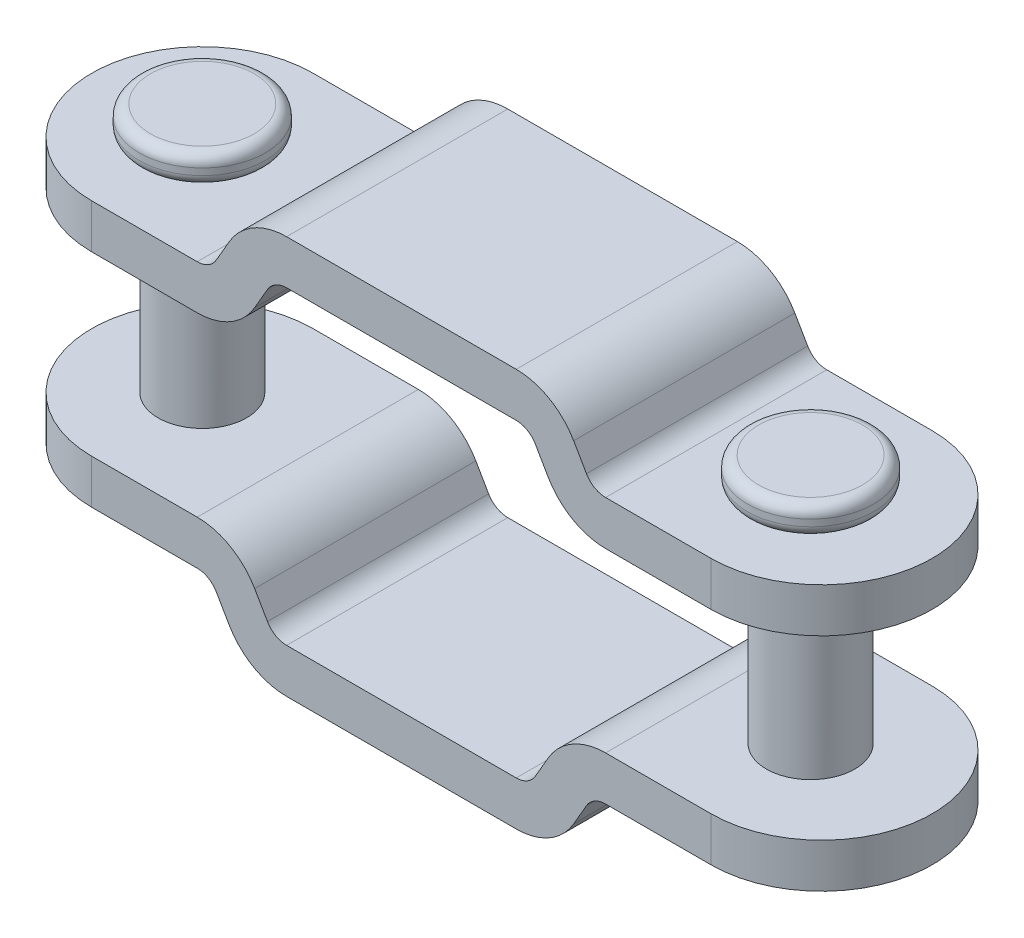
ISO-10303-21;
HEADER;
FILE_DESCRIPTION(('STEP AP214'),'2;1');
FILE_NAME('part.step','',(''),(''),'','','');
FILE_SCHEMA(('AUTOMOTIVE_DESIGN { 1 0 10303 214 1 1 1 1 }'));
ENDSEC;
DATA;
#1=APPLICATION_CONTEXT('core data for automotive mechanical design processes');
#2=APPLICATION_PROTOCOL_DEFINITION('international standard','automotive_design',2000,#1);
#3=PRODUCT_CONTEXT('',#1,'mechanical');
#4=PRODUCT('Part','Part','',(#3));
#5=PRODUCT_RELATED_PRODUCT_CATEGORY('part','',(#4));
#6=PRODUCT_DEFINITION_FORMATION('','',#4);
#7=PRODUCT_DEFINITION_CONTEXT('part definition',#1,'design');
#8=PRODUCT_DEFINITION('design','',#6,#7);
#9=PRODUCT_DEFINITION_SHAPE('','',#8);
#10=(LENGTH_UNIT() NAMED_UNIT(*) SI_UNIT(.MILLI.,.METRE.));
#11=(NAMED_UNIT(*) PLANE_ANGLE_UNIT() SI_UNIT($,.RADIAN.));
#12=(NAMED_UNIT(*) SI_UNIT($,.STERADIAN.) SOLID_ANGLE_UNIT());
#13=UNCERTAINTY_MEASURE_WITH_UNIT(LENGTH_MEASURE(1.E-05),#10,'distance_accuracy_value','');
#14=(GEOMETRIC_REPRESENTATION_CONTEXT(3) GLOBAL_UNCERTAINTY_ASSIGNED_CONTEXT((#13)) GLOBAL_UNIT_ASSIGNED_CONTEXT((#10,
#11,#12)) REPRESENTATION_CONTEXT('',''));
#15=CARTESIAN_POINT('',(0.,0.,0.));
#16=DIRECTION('',(0.,0.,1.));
#17=DIRECTION('',(1.,0.,0.));
#18=AXIS2_PLACEMENT_3D('',#15,#16,#17);
#19=CARTESIAN_POINT('',(27.5,-7.30000000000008,0.));
#20=DIRECTION('',(0.,1.,0.));
#21=DIRECTION('',(-0.126455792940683,0.,-0.991972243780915));
#22=AXIS2_PLACEMENT_3D('',#19,#20,#21);
#23=PLANE('',#22);
#24=CARTESIAN_POINT('',(27.5,-7.30000000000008,0.));
#25=DIRECTION('',(0.,-1.,0.));
#26=DIRECTION('',(-0.991972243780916,0.,0.12645579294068));
#27=AXIS2_PLACEMENT_3D('',#24,#25,#26);
#28=CIRCLE('',#27,2.35);
#29=CARTESIAN_POINT('',(25.1688652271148,-7.30000000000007,0.297171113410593));
#30=VERTEX_POINT('',#29);
#31=EDGE_CURVE('E678',#30,#30,#28,.T.);
#32=ORIENTED_EDGE('',*,*,#31,.T.);
#33=EDGE_LOOP('',(#32));
#34=FACE_BOUND('',#33,.T.);
#35=ADVANCED_FACE('F17',(#34),#23,.F.);
#36=CARTESIAN_POINT('',(27.5,-6.80000000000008,0.));
#37=DIRECTION('',(0.,1.,0.));
#38=DIRECTION('',(-0.991972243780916,0.,0.12645579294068));
#39=AXIS2_PLACEMENT_3D('',#36,#37,#38);
#40=TOROIDAL_SURFACE('',#39,2.35,0.5);
#41=CARTESIAN_POINT('',(27.5,-6.80000000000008,0.));
#42=DIRECTION('',(0.,1.,0.));
#43=DIRECTION('',(-0.991972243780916,0.,0.12645579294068));
#44=AXIS2_PLACEMENT_3D('',#41,#42,#43);
#45=CIRCLE('',#44,2.85);
#46=CARTESIAN_POINT('',(24.6728791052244,-6.80000000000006,0.360399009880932));
#47=VERTEX_POINT('',#46);
#48=EDGE_CURVE('E2133',#47,#47,#45,.T.);
#49=ORIENTED_EDGE('',*,*,#48,.F.);
#50=EDGE_LOOP('',(#49));
#51=FACE_BOUND('',#50,.T.);
#52=ORIENTED_EDGE('',*,*,#31,.F.);
#53=EDGE_LOOP('',(#52));
#54=FACE_BOUND('',#53,.T.);
#55=ADVANCED_FACE('F2175',(#51,#54),#40,.T.);
#56=CARTESIAN_POINT('',(27.5,-6.00000000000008,0.));
#57=DIRECTION('',(0.,-1.,0.));
#58=DIRECTION('',(0.991972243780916,0.,-0.12645579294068));
#59=AXIS2_PLACEMENT_3D('',#56,#57,#58);
#60=CYLINDRICAL_SURFACE('',#59,2.85);
#61=ORIENTED_EDGE('',*,*,#48,.T.);
#62=EDGE_LOOP('',(#61));
#63=FACE_BOUND('',#62,.T.);
#64=CARTESIAN_POINT('',(27.5,-6.50000000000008,0.));
#65=DIRECTION('',(0.,-1.,0.));
#66=DIRECTION('',(-0.991972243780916,0.,0.12645579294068));
#67=AXIS2_PLACEMENT_3D('',#64,#65,#66);
#68=CIRCLE('',#67,2.85);
#69=CARTESIAN_POINT('',(24.6728791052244,-6.50000000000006,0.360399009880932));
#70=VERTEX_POINT('',#69);
#71=EDGE_CURVE('E2126',#70,#70,#68,.T.);
#72=ORIENTED_EDGE('',*,*,#71,.T.);
#73=EDGE_LOOP('',(#72));
#74=FACE_BOUND('',#73,.T.);
#75=ADVANCED_FACE('F2159',(#63,#74),#60,.T.);
#76=CARTESIAN_POINT('',(27.5,-6.50000000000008,0.));
#77=DIRECTION('',(0.,1.,0.));
#78=DIRECTION('',(-0.991972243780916,0.,0.12645579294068));
#79=AXIS2_PLACEMENT_3D('',#76,#77,#78);
#80=TOROIDAL_SURFACE('',#79,2.35,0.5);
#81=CARTESIAN_POINT('',(27.5,-6.00000000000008,0.));
#82=DIRECTION('',(0.,1.,0.));
#83=DIRECTION('',(-0.991972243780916,0.,0.12645579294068));
#84=AXIS2_PLACEMENT_3D('',#81,#82,#83);
#85=CIRCLE('',#84,2.35);
#86=CARTESIAN_POINT('',(25.1688652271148,-6.00000000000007,0.297171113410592));
#87=VERTEX_POINT('',#86);
#88=EDGE_CURVE('E2138',#87,#87,#85,.T.);
#89=ORIENTED_EDGE('',*,*,#88,.F.);
#90=EDGE_LOOP('',(#89));
#91=FACE_BOUND('',#90,.T.);
#92=ORIENTED_EDGE('',*,*,#71,.F.);
#93=EDGE_LOOP('',(#92));
#94=FACE_BOUND('',#93,.T.);
#95=ADVANCED_FACE('F2161',(#91,#94),#80,.T.);
#96=CARTESIAN_POINT('',(27.5,-6.00000000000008,0.));
#97=DIRECTION('',(0.,1.,0.));
#98=DIRECTION('',(-0.991972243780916,0.,0.12645579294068));
#99=AXIS2_PLACEMENT_3D('',#96,#97,#98);
#100=CYLINDRICAL_SURFACE('',#99,2.);
#101=CARTESIAN_POINT('',(27.5,3.99999999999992,0.));
#102=DIRECTION('',(0.,-1.,0.));
#103=DIRECTION('',(1.,0.,0.));
#104=AXIS2_PLACEMENT_3D('',#101,#102,#103);
#105=CIRCLE('',#104,2.);
#106=CARTESIAN_POINT('',(29.5,3.99999999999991,0.));
#107=VERTEX_POINT('',#106);
#108=EDGE_CURVE('E11',#107,#107,#105,.F.);
#109=ORIENTED_EDGE('',*,*,#108,.F.);
#110=EDGE_LOOP('',(#109));
#111=FACE_BOUND('',#110,.T.);
#112=CARTESIAN_POINT('',(27.5,-4.00000000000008,0.));
#113=DIRECTION('',(0.,1.,0.));
#114=DIRECTION('',(-1.,0.,0.));
#115=AXIS2_PLACEMENT_3D('',#112,#113,#114);
#116=CIRCLE('',#115,2.);
#117=CARTESIAN_POINT('',(25.5,-4.00000000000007,0.));
#118=VERTEX_POINT('',#117);
#119=EDGE_CURVE('E28',#118,#118,#116,.F.);
#120=ORIENTED_EDGE('',*,*,#119,.F.);
#121=EDGE_LOOP('',(#120));
#122=FACE_BOUND('',#121,.T.);
#123=ADVANCED_FACE('F2163',(#111,#122),#100,.T.);
#124=CARTESIAN_POINT('',(27.5,7.29999999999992,0.));
#125=DIRECTION('',(0.,-1.,0.));
#126=DIRECTION('',(0.991972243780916,0.,-0.12645579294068));
#127=AXIS2_PLACEMENT_3D('',#124,#125,#126);
#128=PLANE('',#127);
#129=CARTESIAN_POINT('',(27.5,7.29999999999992,0.));
#130=DIRECTION('',(0.,1.,0.));
#131=DIRECTION('',(0.991972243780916,0.,-0.126455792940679));
#132=AXIS2_PLACEMENT_3D('',#129,#130,#131);
#133=CIRCLE('',#132,2.35);
#134=CARTESIAN_POINT('',(29.8311347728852,7.29999999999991,-0.297171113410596));
#135=VERTEX_POINT('',#134);
#136=EDGE_CURVE('E2132',#135,#135,#133,.T.);
#137=ORIENTED_EDGE('',*,*,#136,.T.);
#138=EDGE_LOOP('',(#137));
#139=FACE_BOUND('',#138,.T.);
#140=ADVANCED_FACE('F2166',(#139),#128,.F.);
#141=CARTESIAN_POINT('',(27.5,6.79999999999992,0.));
#142=DIRECTION('',(0.,-1.,0.));
#143=DIRECTION('',(0.991972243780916,0.,-0.12645579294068));
#144=AXIS2_PLACEMENT_3D('',#141,#142,#143);
#145=TOROIDAL_SURFACE('',#144,2.35,0.5);
#146=CARTESIAN_POINT('',(27.5,6.79999999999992,0.));
#147=DIRECTION('',(0.,-1.,0.));
#148=DIRECTION('',(0.991972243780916,0.,-0.12645579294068));
#149=AXIS2_PLACEMENT_3D('',#146,#147,#148);
#150=CIRCLE('',#149,2.85);
#151=CARTESIAN_POINT('',(30.3271208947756,6.7999999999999,-0.36039900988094));
#152=VERTEX_POINT('',#151);
#153=EDGE_CURVE('E2131',#152,#152,#150,.T.);
#154=ORIENTED_EDGE('',*,*,#153,.F.);
#155=EDGE_LOOP('',(#154));
#156=FACE_BOUND('',#155,.T.);
#157=ORIENTED_EDGE('',*,*,#136,.F.);
#158=EDGE_LOOP('',(#157));
#159=FACE_BOUND('',#158,.T.);
#160=ADVANCED_FACE('F2181',(#156,#159),#145,.T.);
#161=CARTESIAN_POINT('',(27.5,5.99999999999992,0.));
#162=DIRECTION('',(0.,1.,0.));
#163=DIRECTION('',(-0.991972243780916,0.,0.12645579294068));
#164=AXIS2_PLACEMENT_3D('',#161,#162,#163);
#165=CYLINDRICAL_SURFACE('',#164,2.85);
#166=ORIENTED_EDGE('',*,*,#153,.T.);
#167=EDGE_LOOP('',(#166));
#168=FACE_BOUND('',#167,.T.);
#169=CARTESIAN_POINT('',(27.5,6.49999999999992,0.));
#170=DIRECTION('',(0.,1.,0.));
#171=DIRECTION('',(0.991972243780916,0.,-0.126455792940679));
#172=AXIS2_PLACEMENT_3D('',#169,#170,#171);
#173=CIRCLE('',#172,2.85);
#174=CARTESIAN_POINT('',(30.3271208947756,6.4999999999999,-0.360399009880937));
#175=VERTEX_POINT('',#174);
#176=EDGE_CURVE('E2137',#175,#175,#173,.T.);
#177=ORIENTED_EDGE('',*,*,#176,.T.);
#178=EDGE_LOOP('',(#177));
#179=FACE_BOUND('',#178,.T.);
#180=ADVANCED_FACE('F2188',(#168,#179),#165,.T.);
#181=CARTESIAN_POINT('',(27.5,6.49999999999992,0.));
#182=DIRECTION('',(0.,-1.,0.));
#183=DIRECTION('',(0.991972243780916,0.,-0.12645579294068));
#184=AXIS2_PLACEMENT_3D('',#181,#182,#183);
#185=TOROIDAL_SURFACE('',#184,2.35,0.5);
#186=CARTESIAN_POINT('',(27.5,5.99999999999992,0.));
#187=DIRECTION('',(0.,-1.,0.));
#188=DIRECTION('',(0.991972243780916,0.,-0.12645579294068));
#189=AXIS2_PLACEMENT_3D('',#186,#187,#188);
#190=CIRCLE('',#189,2.35);
#191=CARTESIAN_POINT('',(29.8311347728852,5.99999999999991,-0.297171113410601));
#192=VERTEX_POINT('',#191);
#193=EDGE_CURVE('E2127',#192,#192,#190,.T.);
#194=ORIENTED_EDGE('',*,*,#193,.F.);
#195=EDGE_LOOP('',(#194));
#196=FACE_BOUND('',#195,.T.);
#197=ORIENTED_EDGE('',*,*,#176,.F.);
#198=EDGE_LOOP('',(#197));
#199=FACE_BOUND('',#198,.T.);
#200=ADVANCED_FACE('F1319',(#196,#199),#185,.T.);
#201=CARTESIAN_POINT('',(0.,7.3,0.));
#202=DIRECTION('',(0.,-1.,0.));
#203=DIRECTION('',(0.991972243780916,0.,-0.12645579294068));
#204=AXIS2_PLACEMENT_3D('',#201,#202,#203);
#205=PLANE('',#204);
#206=CARTESIAN_POINT('',(0.,7.3,0.));
#207=DIRECTION('',(0.,1.,0.));
#208=DIRECTION('',(0.991972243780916,0.,-0.12645579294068));
#209=AXIS2_PLACEMENT_3D('',#206,#207,#208);
#210=CIRCLE('',#209,2.35);
#211=CARTESIAN_POINT('',(2.33113477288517,7.29999999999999,-0.297171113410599));
#212=VERTEX_POINT('',#211);
#213=EDGE_CURVE('E658',#212,#212,#210,.T.);
#214=ORIENTED_EDGE('',*,*,#213,.T.);
#215=EDGE_LOOP('',(#214));
#216=FACE_BOUND('',#215,.T.);
#217=ADVANCED_FACE('F1312',(#216),#205,.F.);
#218=CARTESIAN_POINT('',(0.,-7.3,0.));
#219=DIRECTION('',(0.,1.,0.));
#220=DIRECTION('',(-0.126455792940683,0.,-0.991972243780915));
#221=AXIS2_PLACEMENT_3D('',#218,#219,#220);
#222=PLANE('',#221);
#223=CARTESIAN_POINT('',(0.,-7.3,0.));
#224=DIRECTION('',(0.,-1.,0.));
#225=DIRECTION('',(-0.991972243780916,0.,0.12645579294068));
#226=AXIS2_PLACEMENT_3D('',#223,#224,#225);
#227=CIRCLE('',#226,2.35);
#228=CARTESIAN_POINT('',(-2.33113477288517,-7.29999999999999,0.297171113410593));
#229=VERTEX_POINT('',#228);
#230=EDGE_CURVE('E737',#229,#229,#227,.T.);
#231=ORIENTED_EDGE('',*,*,#230,.T.);
#232=EDGE_LOOP('',(#231));
#233=FACE_BOUND('',#232,.T.);
#234=ADVANCED_FACE('F1318',(#233),#222,.F.);
#235=CARTESIAN_POINT('',(0.,6.8,0.));
#236=DIRECTION('',(0.,-1.,0.));
#237=DIRECTION('',(0.991972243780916,0.,-0.12645579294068));
#238=AXIS2_PLACEMENT_3D('',#235,#236,#237);
#239=TOROIDAL_SURFACE('',#238,2.35,0.5);
#240=CARTESIAN_POINT('',(0.,6.8,0.));
#241=DIRECTION('',(0.,-1.,0.));
#242=DIRECTION('',(0.991972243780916,0.,-0.12645579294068));
#243=AXIS2_PLACEMENT_3D('',#240,#241,#242);
#244=CIRCLE('',#243,2.85);
#245=CARTESIAN_POINT('',(2.82712089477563,6.79999999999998,-0.36039900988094));
#246=VERTEX_POINT('',#245);
#247=EDGE_CURVE('E657',#246,#246,#244,.T.);
#248=ORIENTED_EDGE('',*,*,#247,.F.);
#249=EDGE_LOOP('',(#248));
#250=FACE_BOUND('',#249,.T.);
#251=ORIENTED_EDGE('',*,*,#213,.F.);
#252=EDGE_LOOP('',(#251));
#253=FACE_BOUND('',#252,.T.);
#254=ADVANCED_FACE('F1329',(#250,#253),#239,.T.);
#255=CARTESIAN_POINT('',(0.,-6.8,0.));
#256=DIRECTION('',(0.,1.,0.));
#257=DIRECTION('',(-0.991972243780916,0.,0.12645579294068));
#258=AXIS2_PLACEMENT_3D('',#255,#256,#257);
#259=TOROIDAL_SURFACE('',#258,2.35,0.5);
#260=CARTESIAN_POINT('',(0.,-6.8,0.));
#261=DIRECTION('',(0.,1.,0.));
#262=DIRECTION('',(-0.991972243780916,0.,0.12645579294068));
#263=AXIS2_PLACEMENT_3D('',#260,#261,#262);
#264=CIRCLE('',#263,2.85);
#265=CARTESIAN_POINT('',(-2.82712089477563,-6.79999999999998,0.360399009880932));
#266=VERTEX_POINT('',#265);
#267=EDGE_CURVE('E672',#266,#266,#264,.T.);
#268=ORIENTED_EDGE('',*,*,#267,.F.);
#269=EDGE_LOOP('',(#268));
#270=FACE_BOUND('',#269,.T.);
#271=ORIENTED_EDGE('',*,*,#230,.F.);
#272=EDGE_LOOP('',(#271));
#273=FACE_BOUND('',#272,.T.);
#274=ADVANCED_FACE('F1334',(#270,#273),#259,.T.);
#275=CARTESIAN_POINT('',(0.,6.,0.));
#276=DIRECTION('',(0.,1.,0.));
#277=DIRECTION('',(-0.991972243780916,0.,0.12645579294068));
#278=AXIS2_PLACEMENT_3D('',#275,#276,#277);
#279=CYLINDRICAL_SURFACE('',#278,2.85);
#280=ORIENTED_EDGE('',*,*,#247,.T.);
#281=EDGE_LOOP('',(#280));
#282=FACE_BOUND('',#281,.T.);
#283=CARTESIAN_POINT('',(0.,6.5,0.));
#284=DIRECTION('',(0.,1.,0.));
#285=DIRECTION('',(0.991972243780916,0.,-0.126455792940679));
#286=AXIS2_PLACEMENT_3D('',#283,#284,#285);
#287=CIRCLE('',#286,2.85);
#288=CARTESIAN_POINT('',(2.82712089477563,6.49999999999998,-0.360399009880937));
#289=VERTEX_POINT('',#288);
#290=EDGE_CURVE('E666',#289,#289,#287,.T.);
#291=ORIENTED_EDGE('',*,*,#290,.T.);
#292=EDGE_LOOP('',(#291));
#293=FACE_BOUND('',#292,.T.);
#294=ADVANCED_FACE('F1343',(#282,#293),#279,.T.);
#295=CARTESIAN_POINT('',(0.,-6.,0.));
#296=DIRECTION('',(0.,-1.,0.));
#297=DIRECTION('',(0.991972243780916,0.,-0.12645579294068));
#298=AXIS2_PLACEMENT_3D('',#295,#296,#297);
#299=CYLINDRICAL_SURFACE('',#298,2.85);
#300=ORIENTED_EDGE('',*,*,#267,.T.);
#301=EDGE_LOOP('',(#300));
#302=FACE_BOUND('',#301,.T.);
#303=CARTESIAN_POINT('',(0.,-6.5,0.));
#304=DIRECTION('',(0.,-1.,0.));
#305=DIRECTION('',(-0.991972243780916,0.,0.12645579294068));
#306=AXIS2_PLACEMENT_3D('',#303,#304,#305);
#307=CIRCLE('',#306,2.85);
#308=CARTESIAN_POINT('',(-2.82712089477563,-6.49999999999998,0.360399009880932));
#309=VERTEX_POINT('',#308);
#310=EDGE_CURVE('E468',#309,#309,#307,.T.);
#311=ORIENTED_EDGE('',*,*,#310,.T.);
#312=EDGE_LOOP('',(#311));
#313=FACE_BOUND('',#312,.T.);
#314=ADVANCED_FACE('F1348',(#302,#313),#299,.T.);
#315=CARTESIAN_POINT('',(0.,-6.,0.));
#316=DIRECTION('',(0.,1.,0.));
#317=DIRECTION('',(-0.991972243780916,0.,0.12645579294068));
#318=AXIS2_PLACEMENT_3D('',#315,#316,#317);
#319=CYLINDRICAL_SURFACE('',#318,2.);
#320=CARTESIAN_POINT('',(0.,4.,0.));
#321=DIRECTION('',(0.,1.,0.));
#322=DIRECTION('',(0.,0.,-1.));
#323=AXIS2_PLACEMENT_3D('',#320,#321,#322);
#324=CIRCLE('',#323,2.);
#325=CARTESIAN_POINT('',(0.,4.,-2.00000000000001));
#326=VERTEX_POINT('',#325);
#327=EDGE_CURVE('E464',#326,#326,#324,.T.);
#328=ORIENTED_EDGE('',*,*,#327,.F.);
#329=EDGE_LOOP('',(#328));
#330=FACE_BOUND('',#329,.T.);
#331=CARTESIAN_POINT('',(0.,-4.,0.));
#332=DIRECTION('',(0.,1.,0.));
#333=DIRECTION('',(-1.,0.,0.));
#334=AXIS2_PLACEMENT_3D('',#331,#332,#333);
#335=CIRCLE('',#334,2.);
#336=CARTESIAN_POINT('',(-2.00000000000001,-3.99999999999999,0.));
#337=VERTEX_POINT('',#336);
#338=EDGE_CURVE('E467',#337,#337,#335,.F.);
#339=ORIENTED_EDGE('',*,*,#338,.F.);
#340=EDGE_LOOP('',(#339));
#341=FACE_BOUND('',#340,.T.);
#342=ADVANCED_FACE('F1366',(#330,#341),#319,.T.);
#343=CARTESIAN_POINT('',(0.,-6.5,0.));
#344=DIRECTION('',(0.,1.,0.));
#345=DIRECTION('',(-0.991972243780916,0.,0.12645579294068));
#346=AXIS2_PLACEMENT_3D('',#343,#344,#345);
#347=TOROIDAL_SURFACE('',#346,2.35,0.5);
#348=CARTESIAN_POINT('',(0.,-6.,0.));
#349=DIRECTION('',(0.,1.,0.));
#350=DIRECTION('',(-0.991972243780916,0.,0.12645579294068));
#351=AXIS2_PLACEMENT_3D('',#348,#349,#350);
#352=CIRCLE('',#351,2.35);
#353=CARTESIAN_POINT('',(-2.33113477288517,-5.99999999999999,0.297171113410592));
#354=VERTEX_POINT('',#353);
#355=EDGE_CURVE('E669',#354,#354,#352,.T.);
#356=ORIENTED_EDGE('',*,*,#355,.F.);
#357=EDGE_LOOP('',(#356));
#358=FACE_BOUND('',#357,.T.);
#359=ORIENTED_EDGE('',*,*,#310,.F.);
#360=EDGE_LOOP('',(#359));
#361=FACE_BOUND('',#360,.T.);
#362=ADVANCED_FACE('F1370',(#358,#361),#347,.T.);
#363=CARTESIAN_POINT('',(0.,-4.,0.));
#364=DIRECTION('',(0.,-1.,0.));
#365=DIRECTION('',(0.,0.,1.));
#366=AXIS2_PLACEMENT_3D('',#363,#364,#365);
#367=CYLINDRICAL_SURFACE('',#366,5.);
#368=DIRECTION('',(0.,1.,0.));
#369=VECTOR('',#368,1.);
#370=CARTESIAN_POINT('',(0.,-6.5,-5.));
#371=LINE('',#370,#369);
#372=CARTESIAN_POINT('',(0.,-6.,-5.));
#373=VERTEX_POINT('',#372);
#374=CARTESIAN_POINT('',(0.,-4.,-5.));
#375=VERTEX_POINT('',#374);
#376=EDGE_CURVE('E719',#373,#375,#371,.T.);
#377=ORIENTED_EDGE('',*,*,#376,.F.);
#378=CARTESIAN_POINT('',(0.,-6.,0.));
#379=DIRECTION('',(0.,-1.,0.));
#380=DIRECTION('',(0.,0.,-1.));
#381=AXIS2_PLACEMENT_3D('',#378,#379,#380);
#382=CIRCLE('',#381,5.);
#383=CARTESIAN_POINT('',(0.,-6.,5.));
#384=VERTEX_POINT('',#383);
#385=EDGE_CURVE('E752',#384,#373,#382,.T.);
#386=ORIENTED_EDGE('',*,*,#385,.F.);
#387=DIRECTION('',(0.,-1.,0.));
#388=VECTOR('',#387,1.);
#389=CARTESIAN_POINT('',(0.,-6.,5.));
#390=LINE('',#389,#388);
#391=CARTESIAN_POINT('',(0.,-4.,5.));
#392=VERTEX_POINT('',#391);
#393=EDGE_CURVE('E417',#392,#384,#390,.T.);
#394=ORIENTED_EDGE('',*,*,#393,.F.);
#395=CARTESIAN_POINT('',(0.,-4.,0.));
#396=DIRECTION('',(0.,1.,0.));
#397=DIRECTION('',(0.,0.,-1.));
#398=AXIS2_PLACEMENT_3D('',#395,#396,#397);
#399=CIRCLE('',#398,5.);
#400=EDGE_CURVE('E773',#375,#392,#399,.T.);
#401=ORIENTED_EDGE('',*,*,#400,.F.);
#402=EDGE_LOOP('',(#377,#386,#394,#401));
#403=FACE_BOUND('',#402,.T.);
#404=ADVANCED_FACE('F1409',(#403),#367,.T.);
#405=CARTESIAN_POINT('',(6.5,-4.,-5.));
#406=DIRECTION('',(0.,1.,0.));
#407=DIRECTION('',(-1.,0.,0.));
#408=AXIS2_PLACEMENT_3D('',#405,#406,#407);
#409=PLANE('',#408);
#410=ORIENTED_EDGE('',*,*,#400,.T.);
#411=DIRECTION('',(-1.,0.,0.));
#412=VECTOR('',#411,1.);
#413=CARTESIAN_POINT('',(6.5,-4.,5.));
#414=LINE('',#413,#412);
#415=CARTESIAN_POINT('',(4.76794919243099,-4.,5.));
#416=VERTEX_POINT('',#415);
#417=EDGE_CURVE('E837',#416,#392,#414,.T.);
#418=ORIENTED_EDGE('',*,*,#417,.F.);
#419=DIRECTION('',(0.,0.,1.));
#420=VECTOR('',#419,1.);
#421=CARTESIAN_POINT('',(4.76794919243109,-4.,-5.));
#422=LINE('',#421,#420);
#423=CARTESIAN_POINT('',(4.76794919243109,-4.,-5.));
#424=VERTEX_POINT('',#423);
#425=EDGE_CURVE('E707',#424,#416,#422,.T.);
#426=ORIENTED_EDGE('',*,*,#425,.F.);
#427=DIRECTION('',(-1.,0.,0.));
#428=VECTOR('',#427,1.);
#429=CARTESIAN_POINT('',(6.5,-4.,-5.));
#430=LINE('',#429,#428);
#431=EDGE_CURVE('E777',#424,#375,#430,.T.);
#432=ORIENTED_EDGE('',*,*,#431,.T.);
#433=EDGE_LOOP('',(#410,#418,#426,#432));
#434=FACE_BOUND('',#433,.T.);
#435=ORIENTED_EDGE('',*,*,#338,.T.);
#436=EDGE_LOOP('',(#435));
#437=FACE_BOUND('',#436,.T.);
#438=ADVANCED_FACE('F1804',(#434,#437),#409,.T.);
#439=CARTESIAN_POINT('',(6.5,-6.,-5.));
#440=DIRECTION('',(0.,1.,0.));
#441=DIRECTION('',(-1.,0.,0.));
#442=AXIS2_PLACEMENT_3D('',#439,#440,#441);
#443=PLANE('',#442);
#444=DIRECTION('',(-1.,0.,0.));
#445=VECTOR('',#444,1.);
#446=CARTESIAN_POINT('',(6.5,-6.,5.));
#447=LINE('',#446,#445);
#448=CARTESIAN_POINT('',(4.76794919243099,-6.,5.));
#449=VERTEX_POINT('',#448);
#450=EDGE_CURVE('E683',#449,#384,#447,.T.);
#451=ORIENTED_EDGE('',*,*,#450,.T.);
#452=ORIENTED_EDGE('',*,*,#385,.T.);
#453=DIRECTION('',(-1.,0.,0.));
#454=VECTOR('',#453,1.);
#455=CARTESIAN_POINT('',(6.5,-6.,-5.));
#456=LINE('',#455,#454);
#457=CARTESIAN_POINT('',(4.76794919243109,-6.,-5.));
#458=VERTEX_POINT('',#457);
#459=EDGE_CURVE('E723',#458,#373,#456,.T.);
#460=ORIENTED_EDGE('',*,*,#459,.F.);
#461=DIRECTION('',(0.,0.,1.));
#462=VECTOR('',#461,1.);
#463=CARTESIAN_POINT('',(4.76794919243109,-6.,-5.));
#464=LINE('',#463,#462);
#465=EDGE_CURVE('E755',#458,#449,#464,.T.);
#466=ORIENTED_EDGE('',*,*,#465,.T.);
#467=EDGE_LOOP('',(#451,#452,#460,#466));
#468=FACE_BOUND('',#467,.T.);
#469=ORIENTED_EDGE('',*,*,#355,.T.);
#470=EDGE_LOOP('',(#469));
#471=FACE_BOUND('',#470,.T.);
#472=ADVANCED_FACE('F1784',(#468,#471),#443,.F.);
#473=CARTESIAN_POINT('',(4.76794919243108,-7.,-5.));
#474=DIRECTION('',(0.,0.,1.));
#475=DIRECTION('',(0.,1.,0.));
#476=AXIS2_PLACEMENT_3D('',#473,#474,#475);
#477=CYLINDRICAL_SURFACE('',#476,3.);
#478=CARTESIAN_POINT('',(4.76794919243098,-7.,5.));
#479=DIRECTION('',(0.,0.,1.));
#480=DIRECTION('',(0.,-1.,0.));
#481=AXIS2_PLACEMENT_3D('',#478,#479,#480);
#482=CIRCLE('',#481,3.);
#483=CARTESIAN_POINT('',(7.36602540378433,-5.5,5.));
#484=VERTEX_POINT('',#483);
#485=EDGE_CURVE('E682',#484,#416,#482,.T.);
#486=ORIENTED_EDGE('',*,*,#485,.F.);
#487=DIRECTION('',(0.,0.,1.));
#488=VECTOR('',#487,1.);
#489=CARTESIAN_POINT('',(7.36602540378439,-5.5,-5.));
#490=LINE('',#489,#488);
#491=CARTESIAN_POINT('',(7.36602540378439,-5.5,-5.));
#492=VERTEX_POINT('',#491);
#493=EDGE_CURVE('E746',#492,#484,#490,.T.);
#494=ORIENTED_EDGE('',*,*,#493,.F.);
#495=CARTESIAN_POINT('',(4.76794919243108,-7.,-5.));
#496=DIRECTION('',(0.,0.,1.));
#497=DIRECTION('',(0.,-1.,0.));
#498=AXIS2_PLACEMENT_3D('',#495,#496,#497);
#499=CIRCLE('',#498,3.);
#500=EDGE_CURVE('E711',#492,#424,#499,.T.);
#501=ORIENTED_EDGE('',*,*,#500,.T.);
#502=ORIENTED_EDGE('',*,*,#425,.T.);
#503=EDGE_LOOP('',(#486,#494,#501,#502));
#504=FACE_BOUND('',#503,.T.);
#505=ADVANCED_FACE('F1779',(#504),#477,.T.);
#506=CARTESIAN_POINT('',(4.76794919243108,-7.,-5.));
#507=DIRECTION('',(0.,0.,1.));
#508=DIRECTION('',(0.,1.,0.));
#509=AXIS2_PLACEMENT_3D('',#506,#507,#508);
#510=CYLINDRICAL_SURFACE('',#509,1.);
#511=CARTESIAN_POINT('',(4.76794919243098,-7.,5.));
#512=DIRECTION('',(0.,0.,1.));
#513=DIRECTION('',(0.,-1.,0.));
#514=AXIS2_PLACEMENT_3D('',#511,#512,#513);
#515=CIRCLE('',#514,1.);
#516=CARTESIAN_POINT('',(5.63397459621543,-6.5,5.));
#517=VERTEX_POINT('',#516);
#518=EDGE_CURVE('E833',#517,#449,#515,.T.);
#519=ORIENTED_EDGE('',*,*,#518,.T.);
#520=ORIENTED_EDGE('',*,*,#465,.F.);
#521=CARTESIAN_POINT('',(4.76794919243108,-7.,-5.));
#522=DIRECTION('',(0.,0.,1.));
#523=DIRECTION('',(0.,-1.,0.));
#524=AXIS2_PLACEMENT_3D('',#521,#522,#523);
#525=CIRCLE('',#524,1.);
#526=CARTESIAN_POINT('',(5.63397459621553,-6.5,-5.));
#527=VERTEX_POINT('',#526);
#528=EDGE_CURVE('E791',#527,#458,#525,.T.);
#529=ORIENTED_EDGE('',*,*,#528,.F.);
#530=DIRECTION('',(0.,0.,1.));
#531=VECTOR('',#530,1.);
#532=CARTESIAN_POINT('',(5.63397459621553,-6.5,-5.));
#533=LINE('',#532,#531);
#534=EDGE_CURVE('E700',#527,#517,#533,.T.);
#535=ORIENTED_EDGE('',*,*,#534,.T.);
#536=EDGE_LOOP('',(#519,#520,#529,#535));
#537=FACE_BOUND('',#536,.T.);
#538=ADVANCED_FACE('F1762',(#537),#510,.F.);
#539=CARTESIAN_POINT('',(8.23205080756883,-7.,-5.));
#540=DIRECTION('',(0.866025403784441,0.5,0.));
#541=DIRECTION('',(-0.5,0.866025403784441,0.));
#542=AXIS2_PLACEMENT_3D('',#539,#540,#541);
#543=PLANE('',#542);
#544=DIRECTION('',(-0.5,0.866025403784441,0.));
#545=VECTOR('',#544,1.);
#546=CARTESIAN_POINT('',(8.23205080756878,-7.,5.));
#547=LINE('',#546,#545);
#548=CARTESIAN_POINT('',(7.94337567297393,-6.5,5.));
#549=VERTEX_POINT('',#548);
#550=EDGE_CURVE('E679',#549,#484,#547,.T.);
#551=ORIENTED_EDGE('',*,*,#550,.F.);
#552=DIRECTION('',(0.,0.,1.));
#553=VECTOR('',#552,1.);
#554=CARTESIAN_POINT('',(7.94337567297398,-6.5,-5.));
#555=LINE('',#554,#553);
#556=CARTESIAN_POINT('',(7.94337567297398,-6.5,-5.));
#557=VERTEX_POINT('',#556);
#558=EDGE_CURVE('E742',#557,#549,#555,.T.);
#559=ORIENTED_EDGE('',*,*,#558,.F.);
#560=DIRECTION('',(-0.5,0.866025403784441,0.));
#561=VECTOR('',#560,1.);
#562=CARTESIAN_POINT('',(8.23205080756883,-7.,-5.));
#563=LINE('',#562,#561);
#564=EDGE_CURVE('E712',#557,#492,#563,.T.);
#565=ORIENTED_EDGE('',*,*,#564,.T.);
#566=ORIENTED_EDGE('',*,*,#493,.T.);
#567=EDGE_LOOP('',(#551,#559,#565,#566));
#568=FACE_BOUND('',#567,.T.);
#569=ADVANCED_FACE('F1757',(#568),#543,.T.);
#570=CARTESIAN_POINT('',(6.5,-8.,-5.));
#571=DIRECTION('',(0.866025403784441,0.5,0.));
#572=DIRECTION('',(-0.5,0.866025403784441,0.));
#573=AXIS2_PLACEMENT_3D('',#570,#571,#572);
#574=PLANE('',#573);
#575=DIRECTION('',(-0.5,0.866025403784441,0.));
#576=VECTOR('',#575,1.);
#577=CARTESIAN_POINT('',(6.5,-8.,5.));
#578=LINE('',#577,#576);
#579=CARTESIAN_POINT('',(6.21132486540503,-7.5,5.));
#580=VERTEX_POINT('',#579);
#581=EDGE_CURVE('E684',#580,#517,#578,.T.);
#582=ORIENTED_EDGE('',*,*,#581,.T.);
#583=ORIENTED_EDGE('',*,*,#534,.F.);
#584=DIRECTION('',(-0.5,0.866025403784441,0.));
#585=VECTOR('',#584,1.);
#586=CARTESIAN_POINT('',(6.5,-8.,-5.));
#587=LINE('',#586,#585);
#588=CARTESIAN_POINT('',(6.21132486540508,-7.5,-5.));
#589=VERTEX_POINT('',#588);
#590=EDGE_CURVE('E869',#589,#527,#587,.T.);
#591=ORIENTED_EDGE('',*,*,#590,.F.);
#592=DIRECTION('',(0.,0.,1.));
#593=VECTOR('',#592,1.);
#594=CARTESIAN_POINT('',(6.21132486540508,-7.5,-5.));
#595=LINE('',#594,#593);
#596=EDGE_CURVE('E689',#589,#580,#595,.T.);
#597=ORIENTED_EDGE('',*,*,#596,.T.);
#598=EDGE_LOOP('',(#582,#583,#591,#597));
#599=FACE_BOUND('',#598,.T.);
#600=ADVANCED_FACE('F1740',(#599),#574,.F.);
#601=CARTESIAN_POINT('',(8.80940107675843,-6.,-5.));
#602=DIRECTION('',(0.,0.,1.));
#603=DIRECTION('',(0.,1.,0.));
#604=AXIS2_PLACEMENT_3D('',#601,#602,#603);
#605=CYLINDRICAL_SURFACE('',#604,1.);
#606=CARTESIAN_POINT('',(8.80940107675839,-6.,5.));
#607=DIRECTION('',(0.,0.,-1.));
#608=DIRECTION('',(0.,1.,0.));
#609=AXIS2_PLACEMENT_3D('',#606,#607,#608);
#610=CIRCLE('',#609,1.);
#611=CARTESIAN_POINT('',(8.80940107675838,-7.,5.));
#612=VERTEX_POINT('',#611);
#613=EDGE_CURVE('E859',#612,#549,#610,.T.);
#614=ORIENTED_EDGE('',*,*,#613,.F.);
#615=DIRECTION('',(0.,0.,1.));
#616=VECTOR('',#615,1.);
#617=CARTESIAN_POINT('',(8.80940107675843,-7.,-5.));
#618=LINE('',#617,#616);
#619=CARTESIAN_POINT('',(8.80940107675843,-7.,-5.));
#620=VERTEX_POINT('',#619);
#621=EDGE_CURVE('E743',#620,#612,#618,.T.);
#622=ORIENTED_EDGE('',*,*,#621,.F.);
#623=CARTESIAN_POINT('',(8.80940107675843,-6.,-5.));
#624=DIRECTION('',(0.,0.,-1.));
#625=DIRECTION('',(0.,1.,0.));
#626=AXIS2_PLACEMENT_3D('',#623,#624,#625);
#627=CIRCLE('',#626,1.);
#628=EDGE_CURVE('E770',#620,#557,#627,.T.);
#629=ORIENTED_EDGE('',*,*,#628,.T.);
#630=ORIENTED_EDGE('',*,*,#558,.T.);
#631=EDGE_LOOP('',(#614,#622,#629,#630));
#632=FACE_BOUND('',#631,.T.);
#633=ADVANCED_FACE('F1735',(#632),#605,.F.);
#634=CARTESIAN_POINT('',(8.80940107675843,-6.,-5.));
#635=DIRECTION('',(0.,0.,1.));
#636=DIRECTION('',(0.,1.,0.));
#637=AXIS2_PLACEMENT_3D('',#634,#635,#636);
#638=CYLINDRICAL_SURFACE('',#637,3.);
#639=CARTESIAN_POINT('',(8.80940107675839,-6.,5.));
#640=DIRECTION('',(0.,0.,-1.));
#641=DIRECTION('',(0.,-1.,0.));
#642=AXIS2_PLACEMENT_3D('',#639,#640,#641);
#643=CIRCLE('',#642,3.);
#644=CARTESIAN_POINT('',(8.80940107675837,-9.,5.));
#645=VERTEX_POINT('',#644);
#646=EDGE_CURVE('E802',#645,#580,#643,.T.);
#647=ORIENTED_EDGE('',*,*,#646,.T.);
#648=ORIENTED_EDGE('',*,*,#596,.F.);
#649=CARTESIAN_POINT('',(8.80940107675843,-6.,-5.));
#650=DIRECTION('',(0.,0.,-1.));
#651=DIRECTION('',(0.,-1.,0.));
#652=AXIS2_PLACEMENT_3D('',#649,#650,#651);
#653=CIRCLE('',#652,3.);
#654=CARTESIAN_POINT('',(8.80940107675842,-9.,-5.));
#655=VERTEX_POINT('',#654);
#656=EDGE_CURVE('E751',#655,#589,#653,.T.);
#657=ORIENTED_EDGE('',*,*,#656,.F.);
#658=DIRECTION('',(0.,0.,1.));
#659=VECTOR('',#658,1.);
#660=CARTESIAN_POINT('',(8.80940107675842,-9.,-5.));
#661=LINE('',#660,#659);
#662=EDGE_CURVE('E688',#655,#645,#661,.T.);
#663=ORIENTED_EDGE('',*,*,#662,.T.);
#664=EDGE_LOOP('',(#647,#648,#657,#663));
#665=FACE_BOUND('',#664,.T.);
#666=ADVANCED_FACE('F1718',(#665),#638,.T.);
#667=CARTESIAN_POINT('',(19.7679491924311,-7.,-5.));
#668=DIRECTION('',(0.,1.,0.));
#669=DIRECTION('',(-1.,0.,0.));
#670=AXIS2_PLACEMENT_3D('',#667,#668,#669);
#671=PLANE('',#670);
#672=DIRECTION('',(-1.,0.,0.));
#673=VECTOR('',#672,1.);
#674=CARTESIAN_POINT('',(19.7679491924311,-7.,5.));
#675=LINE('',#674,#673);
#676=CARTESIAN_POINT('',(19.1905989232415,-7.,5.));
#677=VERTEX_POINT('',#676);
#678=EDGE_CURVE('E856',#677,#612,#675,.T.);
#679=ORIENTED_EDGE('',*,*,#678,.F.);
#680=DIRECTION('',(0.,0.,1.));
#681=VECTOR('',#680,1.);
#682=CARTESIAN_POINT('',(19.1905989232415,-7.,-5.));
#683=LINE('',#682,#681);
#684=CARTESIAN_POINT('',(19.1905989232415,-7.,-5.));
#685=VERTEX_POINT('',#684);
#686=EDGE_CURVE('E815',#685,#677,#683,.T.);
#687=ORIENTED_EDGE('',*,*,#686,.F.);
#688=DIRECTION('',(-1.,0.,0.));
#689=VECTOR('',#688,1.);
#690=CARTESIAN_POINT('',(19.7679491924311,-7.,-5.));
#691=LINE('',#690,#689);
#692=EDGE_CURVE('E739',#685,#620,#691,.T.);
#693=ORIENTED_EDGE('',*,*,#692,.T.);
#694=ORIENTED_EDGE('',*,*,#621,.T.);
#695=EDGE_LOOP('',(#679,#687,#693,#694));
#696=FACE_BOUND('',#695,.T.);
#697=ADVANCED_FACE('F1713',(#696),#671,.T.);
#698=CARTESIAN_POINT('',(19.767949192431,-9.,-5.));
#699=DIRECTION('',(0.,1.,0.));
#700=DIRECTION('',(-1.,0.,0.));
#701=AXIS2_PLACEMENT_3D('',#698,#699,#700);
#702=PLANE('',#701);
#703=DIRECTION('',(-1.,0.,0.));
#704=VECTOR('',#703,1.);
#705=CARTESIAN_POINT('',(19.767949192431,-9.,5.));
#706=LINE('',#705,#704);
#707=CARTESIAN_POINT('',(19.1905989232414,-9.,5.));
#708=VERTEX_POINT('',#707);
#709=EDGE_CURVE('E713',#708,#645,#706,.T.);
#710=ORIENTED_EDGE('',*,*,#709,.T.);
#711=ORIENTED_EDGE('',*,*,#662,.F.);
#712=DIRECTION('',(-1.,0.,0.));
#713=VECTOR('',#712,1.);
#714=CARTESIAN_POINT('',(19.767949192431,-9.,-5.));
#715=LINE('',#714,#713);
#716=CARTESIAN_POINT('',(19.1905989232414,-9.,-5.));
#717=VERTEX_POINT('',#716);
#718=EDGE_CURVE('E732',#717,#655,#715,.T.);
#719=ORIENTED_EDGE('',*,*,#718,.F.);
#720=DIRECTION('',(0.,0.,1.));
#721=VECTOR('',#720,1.);
#722=CARTESIAN_POINT('',(19.1905989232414,-9.,-5.));
#723=LINE('',#722,#721);
#724=EDGE_CURVE('E718',#717,#708,#723,.T.);
#725=ORIENTED_EDGE('',*,*,#724,.T.);
#726=EDGE_LOOP('',(#710,#711,#719,#725));
#727=FACE_BOUND('',#726,.T.);
#728=ADVANCED_FACE('F1696',(#727),#702,.F.);
#729=CARTESIAN_POINT('',(19.1905989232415,-6.,-5.));
#730=DIRECTION('',(0.,0.,1.));
#731=DIRECTION('',(0.,1.,0.));
#732=AXIS2_PLACEMENT_3D('',#729,#730,#731);
#733=CYLINDRICAL_SURFACE('',#732,1.);
#734=CARTESIAN_POINT('',(19.1905989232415,-6.,5.));
#735=DIRECTION('',(0.,0.,-1.));
#736=DIRECTION('',(0.,1.,0.));
#737=AXIS2_PLACEMENT_3D('',#734,#735,#736);
#738=CIRCLE('',#737,1.);
#739=CARTESIAN_POINT('',(20.0566243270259,-6.5,5.));
#740=VERTEX_POINT('',#739);
#741=EDGE_CURVE('E750',#740,#677,#738,.T.);
#742=ORIENTED_EDGE('',*,*,#741,.F.);
#743=DIRECTION('',(0.,0.,1.));
#744=VECTOR('',#743,1.);
#745=CARTESIAN_POINT('',(20.0566243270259,-6.5,-5.));
#746=LINE('',#745,#744);
#747=CARTESIAN_POINT('',(20.0566243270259,-6.5,-5.));
#748=VERTEX_POINT('',#747);
#749=EDGE_CURVE('E702',#748,#740,#746,.T.);
#750=ORIENTED_EDGE('',*,*,#749,.F.);
#751=CARTESIAN_POINT('',(19.1905989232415,-6.,-5.));
#752=DIRECTION('',(0.,0.,-1.));
#753=DIRECTION('',(0.,1.,0.));
#754=AXIS2_PLACEMENT_3D('',#751,#752,#753);
#755=CIRCLE('',#754,1.);
#756=EDGE_CURVE('E816',#748,#685,#755,.T.);
#757=ORIENTED_EDGE('',*,*,#756,.T.);
#758=ORIENTED_EDGE('',*,*,#686,.T.);
#759=EDGE_LOOP('',(#742,#750,#757,#758));
#760=FACE_BOUND('',#759,.T.);
#761=ADVANCED_FACE('F1691',(#760),#733,.F.);
#762=CARTESIAN_POINT('',(19.1905989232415,-6.,-5.));
#763=DIRECTION('',(0.,0.,1.));
#764=DIRECTION('',(0.,1.,0.));
#765=AXIS2_PLACEMENT_3D('',#762,#763,#764);
#766=CYLINDRICAL_SURFACE('',#765,3.);
#767=CARTESIAN_POINT('',(19.1905989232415,-6.,5.));
#768=DIRECTION('',(0.,0.,-1.));
#769=DIRECTION('',(0.,-1.,0.));
#770=AXIS2_PLACEMENT_3D('',#767,#768,#769);
#771=CIRCLE('',#770,3.);
#772=CARTESIAN_POINT('',(21.7886751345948,-7.5,5.));
#773=VERTEX_POINT('',#772);
#774=EDGE_CURVE('E798',#773,#708,#771,.T.);
#775=ORIENTED_EDGE('',*,*,#774,.T.);
#776=ORIENTED_EDGE('',*,*,#724,.F.);
#777=CARTESIAN_POINT('',(19.1905989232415,-6.,-5.));
#778=DIRECTION('',(0.,0.,-1.));
#779=DIRECTION('',(0.,-1.,0.));
#780=AXIS2_PLACEMENT_3D('',#777,#778,#779);
#781=CIRCLE('',#780,3.);
#782=CARTESIAN_POINT('',(21.7886751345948,-7.5,-5.));
#783=VERTEX_POINT('',#782);
#784=EDGE_CURVE('E728',#783,#717,#781,.T.);
#785=ORIENTED_EDGE('',*,*,#784,.F.);
#786=DIRECTION('',(0.,0.,1.));
#787=VECTOR('',#786,1.);
#788=CARTESIAN_POINT('',(21.7886751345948,-7.5,-5.));
#789=LINE('',#788,#787);
#790=EDGE_CURVE('E717',#783,#773,#789,.T.);
#791=ORIENTED_EDGE('',*,*,#790,.T.);
#792=EDGE_LOOP('',(#775,#776,#785,#791));
#793=FACE_BOUND('',#792,.T.);
#794=ADVANCED_FACE('F1674',(#793),#766,.T.);
#795=CARTESIAN_POINT('',(21.5,-4.00000000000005,-5.));
#796=DIRECTION('',(-0.866025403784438,0.5,0.));
#797=DIRECTION('',(0.,0.,-1.));
#798=AXIS2_PLACEMENT_3D('',#795,#796,#797);
#799=PLANE('',#798);
#800=DIRECTION('',(-0.5,-0.866025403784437,0.));
#801=VECTOR('',#800,1.);
#802=CARTESIAN_POINT('',(21.5,-4.00000000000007,5.));
#803=LINE('',#802,#801);
#804=CARTESIAN_POINT('',(20.6339745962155,-5.50000000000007,5.));
#805=VERTEX_POINT('',#804);
#806=EDGE_CURVE('E747',#805,#740,#803,.T.);
#807=ORIENTED_EDGE('',*,*,#806,.F.);
#808=DIRECTION('',(0.,0.,1.));
#809=VECTOR('',#808,1.);
#810=CARTESIAN_POINT('',(20.6339745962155,-5.5,-5.));
#811=LINE('',#810,#809);
#812=CARTESIAN_POINT('',(20.6339745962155,-5.5,-5.));
#813=VERTEX_POINT('',#812);
#814=EDGE_CURVE('E756',#813,#805,#811,.T.);
#815=ORIENTED_EDGE('',*,*,#814,.F.);
#816=DIRECTION('',(-0.5,-0.866025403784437,0.));
#817=VECTOR('',#816,1.);
#818=CARTESIAN_POINT('',(21.5,-4.00000000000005,-5.));
#819=LINE('',#818,#817);
#820=EDGE_CURVE('E706',#813,#748,#819,.T.);
#821=ORIENTED_EDGE('',*,*,#820,.T.);
#822=ORIENTED_EDGE('',*,*,#749,.T.);
#823=EDGE_LOOP('',(#807,#815,#821,#822));
#824=FACE_BOUND('',#823,.T.);
#825=ADVANCED_FACE('F1669',(#824),#799,.T.);
#826=CARTESIAN_POINT('',(23.2320508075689,-5.00000000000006,-5.));
#827=DIRECTION('',(-0.866025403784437,0.5,0.));
#828=DIRECTION('',(0.,0.,-1.));
#829=AXIS2_PLACEMENT_3D('',#826,#827,#828);
#830=PLANE('',#829);
#831=DIRECTION('',(-0.5,-0.866025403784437,0.));
#832=VECTOR('',#831,1.);
#833=CARTESIAN_POINT('',(23.2320508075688,-5.00000000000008,5.));
#834=LINE('',#833,#832);
#835=CARTESIAN_POINT('',(22.3660254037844,-6.5,5.));
#836=VERTEX_POINT('',#835);
#837=EDGE_CURVE('E695',#836,#773,#834,.T.);
#838=ORIENTED_EDGE('',*,*,#837,.T.);
#839=ORIENTED_EDGE('',*,*,#790,.F.);
#840=DIRECTION('',(-0.5,-0.866025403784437,0.));
#841=VECTOR('',#840,1.);
#842=CARTESIAN_POINT('',(23.2320508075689,-5.00000000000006,-5.));
#843=LINE('',#842,#841);
#844=CARTESIAN_POINT('',(22.3660254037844,-6.5,-5.));
#845=VERTEX_POINT('',#844);
#846=EDGE_CURVE('E738',#845,#783,#843,.T.);
#847=ORIENTED_EDGE('',*,*,#846,.F.);
#848=DIRECTION('',(0.,0.,1.));
#849=VECTOR('',#848,1.);
#850=CARTESIAN_POINT('',(22.3660254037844,-6.5,-5.));
#851=LINE('',#850,#849);
#852=EDGE_CURVE('E809',#845,#836,#851,.T.);
#853=ORIENTED_EDGE('',*,*,#852,.T.);
#854=EDGE_LOOP('',(#838,#839,#847,#853));
#855=FACE_BOUND('',#854,.T.);
#856=ADVANCED_FACE('F1650',(#855),#830,.F.);
#857=CARTESIAN_POINT('',(23.2320508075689,-7.,-5.));
#858=DIRECTION('',(0.,0.,1.));
#859=DIRECTION('',(0.,1.,0.));
#860=AXIS2_PLACEMENT_3D('',#857,#858,#859);
#861=CYLINDRICAL_SURFACE('',#860,3.);
#862=CARTESIAN_POINT('',(23.2320508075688,-7.00000000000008,5.));
#863=DIRECTION('',(0.,0.,1.));
#864=DIRECTION('',(0.,-1.,0.));
#865=AXIS2_PLACEMENT_3D('',#862,#863,#864);
#866=CIRCLE('',#865,3.);
#867=CARTESIAN_POINT('',(23.2320508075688,-4.00000000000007,5.));
#868=VERTEX_POINT('',#867);
#869=EDGE_CURVE('E769',#868,#805,#866,.T.);
#870=ORIENTED_EDGE('',*,*,#869,.F.);
#871=DIRECTION('',(0.,0.,1.));
#872=VECTOR('',#871,1.);
#873=CARTESIAN_POINT('',(23.2320508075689,-4.00000000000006,-5.));
#874=LINE('',#873,#872);
#875=CARTESIAN_POINT('',(23.2320508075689,-4.00000000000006,-5.));
#876=VERTEX_POINT('',#875);
#877=EDGE_CURVE('E760',#876,#868,#874,.T.);
#878=ORIENTED_EDGE('',*,*,#877,.F.);
#879=CARTESIAN_POINT('',(23.2320508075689,-7.,-5.));
#880=DIRECTION('',(0.,0.,1.));
#881=DIRECTION('',(0.,-1.,0.));
#882=AXIS2_PLACEMENT_3D('',#879,#880,#881);
#883=CIRCLE('',#882,3.);
#884=EDGE_CURVE('E43',#876,#813,#883,.T.);
#885=ORIENTED_EDGE('',*,*,#884,.T.);
#886=ORIENTED_EDGE('',*,*,#814,.T.);
#887=EDGE_LOOP('',(#870,#878,#885,#886));
#888=FACE_BOUND('',#887,.T.);
#889=ADVANCED_FACE('F1620',(#888),#861,.T.);
#890=CARTESIAN_POINT('',(4.76794919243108,-7.,-5.));
#891=DIRECTION('',(0.,0.,-1.));
#892=DIRECTION('',(0.,-1.,0.));
#893=AXIS2_PLACEMENT_3D('',#890,#891,#892);
#894=PLANE('',#893);
#895=DIRECTION('',(-1.,0.,0.));
#896=VECTOR('',#895,1.);
#897=CARTESIAN_POINT('',(33.,-4.00000000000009,-5.));
#898=LINE('',#897,#896);
#899=CARTESIAN_POINT('',(28.,-4.00000000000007,-5.));
#900=VERTEX_POINT('',#899);
#901=EDGE_CURVE('E764',#900,#876,#898,.T.);
#902=ORIENTED_EDGE('',*,*,#901,.F.);
#903=DIRECTION('',(0.,-1.,0.));
#904=VECTOR('',#903,1.);
#905=CARTESIAN_POINT('',(28.,-7.,-5.));
#906=LINE('',#905,#904);
#907=CARTESIAN_POINT('',(28.,-6.00000000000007,-5.));
#908=VERTEX_POINT('',#907);
#909=EDGE_CURVE('E696',#900,#908,#906,.T.);
#910=ORIENTED_EDGE('',*,*,#909,.T.);
#911=DIRECTION('',(-1.,0.,0.));
#912=VECTOR('',#911,1.);
#913=CARTESIAN_POINT('',(33.,-6.00000000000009,-5.));
#914=LINE('',#913,#912);
#915=CARTESIAN_POINT('',(23.2320508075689,-6.,-5.));
#916=VERTEX_POINT('',#915);
#917=EDGE_CURVE('E701',#908,#916,#914,.T.);
#918=ORIENTED_EDGE('',*,*,#917,.T.);
#919=CARTESIAN_POINT('',(23.2320508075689,-7.,-5.));
#920=DIRECTION('',(0.,0.,1.));
#921=DIRECTION('',(0.,-1.,0.));
#922=AXIS2_PLACEMENT_3D('',#919,#920,#921);
#923=CIRCLE('',#922,1.);
#924=EDGE_CURVE('E733',#916,#845,#923,.T.);
#925=ORIENTED_EDGE('',*,*,#924,.T.);
#926=ORIENTED_EDGE('',*,*,#846,.T.);
#927=ORIENTED_EDGE('',*,*,#784,.T.);
#928=ORIENTED_EDGE('',*,*,#718,.T.);
#929=ORIENTED_EDGE('',*,*,#656,.T.);
#930=ORIENTED_EDGE('',*,*,#590,.T.);
#931=ORIENTED_EDGE('',*,*,#528,.T.);
#932=ORIENTED_EDGE('',*,*,#459,.T.);
#933=ORIENTED_EDGE('',*,*,#376,.T.);
#934=ORIENTED_EDGE('',*,*,#431,.F.);
#935=ORIENTED_EDGE('',*,*,#500,.F.);
#936=ORIENTED_EDGE('',*,*,#564,.F.);
#937=ORIENTED_EDGE('',*,*,#628,.F.);
#938=ORIENTED_EDGE('',*,*,#692,.F.);
#939=ORIENTED_EDGE('',*,*,#756,.F.);
#940=ORIENTED_EDGE('',*,*,#820,.F.);
#941=ORIENTED_EDGE('',*,*,#884,.F.);
#942=EDGE_LOOP('',(#902,#910,#918,#925,#926,#927,#928,#929,#930,#931,#932,#933,#934,#935,#936,
#937,#938,#939,#940,#941));
#943=FACE_BOUND('',#942,.T.);
#944=ADVANCED_FACE('F1614',(#943),#894,.T.);
#945=CARTESIAN_POINT('',(23.2320508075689,-7.,-5.));
#946=DIRECTION('',(0.,0.,1.));
#947=DIRECTION('',(0.,1.,0.));
#948=AXIS2_PLACEMENT_3D('',#945,#946,#947);
#949=CYLINDRICAL_SURFACE('',#948,1.);
#950=CARTESIAN_POINT('',(23.2320508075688,-7.00000000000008,5.));
#951=DIRECTION('',(0.,0.,1.));
#952=DIRECTION('',(0.,-1.,0.));
#953=AXIS2_PLACEMENT_3D('',#950,#951,#952);
#954=CIRCLE('',#953,1.);
#955=CARTESIAN_POINT('',(23.2320508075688,-6.00000000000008,5.));
#956=VERTEX_POINT('',#955);
#957=EDGE_CURVE('E694',#956,#836,#954,.T.);
#958=ORIENTED_EDGE('',*,*,#957,.T.);
#959=ORIENTED_EDGE('',*,*,#852,.F.);
#960=ORIENTED_EDGE('',*,*,#924,.F.);
#961=DIRECTION('',(0.,0.,1.));
#962=VECTOR('',#961,1.);
#963=CARTESIAN_POINT('',(23.2320508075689,-6.,-5.));
#964=LINE('',#963,#962);
#965=EDGE_CURVE('E690',#916,#956,#964,.T.);
#966=ORIENTED_EDGE('',*,*,#965,.T.);
#967=EDGE_LOOP('',(#958,#959,#960,#966));
#968=FACE_BOUND('',#967,.T.);
#969=ADVANCED_FACE('F1619',(#968),#949,.F.);
#970=CARTESIAN_POINT('',(22.3660254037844,-6.5,5.));
#971=DIRECTION('',(0.,0.,1.));
#972=DIRECTION('',(1.,0.,0.));
#973=AXIS2_PLACEMENT_3D('',#970,#971,#972);
#974=PLANE('',#973);
#975=DIRECTION('',(-1.,0.,0.));
#976=VECTOR('',#975,1.);
#977=CARTESIAN_POINT('',(33.,-6.0000000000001,5.));
#978=LINE('',#977,#976);
#979=CARTESIAN_POINT('',(28.,-6.00000000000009,5.));
#980=VERTEX_POINT('',#979);
#981=EDGE_CURVE('E784',#980,#956,#978,.T.);
#982=ORIENTED_EDGE('',*,*,#981,.F.);
#983=DIRECTION('',(0.,1.,0.));
#984=VECTOR('',#983,1.);
#985=CARTESIAN_POINT('',(28.,-6.50000000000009,5.));
#986=LINE('',#985,#984);
#987=CARTESIAN_POINT('',(28.,-4.00000000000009,5.));
#988=VERTEX_POINT('',#987);
#989=EDGE_CURVE('E727',#980,#988,#986,.T.);
#990=ORIENTED_EDGE('',*,*,#989,.T.);
#991=DIRECTION('',(-1.,0.,0.));
#992=VECTOR('',#991,1.);
#993=CARTESIAN_POINT('',(33.,-4.0000000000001,5.));
#994=LINE('',#993,#992);
#995=EDGE_CURVE('E724',#988,#868,#994,.T.);
#996=ORIENTED_EDGE('',*,*,#995,.T.);
#997=ORIENTED_EDGE('',*,*,#869,.T.);
#998=ORIENTED_EDGE('',*,*,#806,.T.);
#999=ORIENTED_EDGE('',*,*,#741,.T.);
#1000=ORIENTED_EDGE('',*,*,#678,.T.);
#1001=ORIENTED_EDGE('',*,*,#613,.T.);
#1002=ORIENTED_EDGE('',*,*,#550,.T.);
#1003=ORIENTED_EDGE('',*,*,#485,.T.);
#1004=ORIENTED_EDGE('',*,*,#417,.T.);
#1005=ORIENTED_EDGE('',*,*,#393,.T.);
#1006=ORIENTED_EDGE('',*,*,#450,.F.);
#1007=ORIENTED_EDGE('',*,*,#518,.F.);
#1008=ORIENTED_EDGE('',*,*,#581,.F.);
#1009=ORIENTED_EDGE('',*,*,#646,.F.);
#1010=ORIENTED_EDGE('',*,*,#709,.F.);
#1011=ORIENTED_EDGE('',*,*,#774,.F.);
#1012=ORIENTED_EDGE('',*,*,#837,.F.);
#1013=ORIENTED_EDGE('',*,*,#957,.F.);
#1014=EDGE_LOOP('',(#982,#990,#996,#997,#998,#999,#1000,#1001,#1002,#1003,#1004,#1005,#1006,
#1007,#1008,#1009,#1010,#1011,#1012,#1013));
#1015=FACE_BOUND('',#1014,.T.);
#1016=ADVANCED_FACE('F1607',(#1015),#974,.T.);
#1017=CARTESIAN_POINT('',(28.,-6.50000000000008,0.));
#1018=DIRECTION('',(0.,1.,0.));
#1019=DIRECTION('',(0.,0.,-1.));
#1020=AXIS2_PLACEMENT_3D('',#1017,#1018,#1019);
#1021=CYLINDRICAL_SURFACE('',#1020,5.);
#1022=ORIENTED_EDGE('',*,*,#989,.F.);
#1023=CARTESIAN_POINT('',(28.,-6.00000000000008,0.));
#1024=DIRECTION('',(0.,-1.,0.));
#1025=DIRECTION('',(0.,0.,-1.));
#1026=AXIS2_PLACEMENT_3D('',#1023,#1024,#1025);
#1027=CIRCLE('',#1026,5.);
#1028=EDGE_CURVE('E765',#908,#980,#1027,.T.);
#1029=ORIENTED_EDGE('',*,*,#1028,.F.);
#1030=ORIENTED_EDGE('',*,*,#909,.F.);
#1031=CARTESIAN_POINT('',(28.,-4.00000000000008,0.));
#1032=DIRECTION('',(0.,1.,0.));
#1033=DIRECTION('',(0.,0.,-1.));
#1034=AXIS2_PLACEMENT_3D('',#1031,#1032,#1033);
#1035=CIRCLE('',#1034,5.);
#1036=EDGE_CURVE('E759',#988,#900,#1035,.T.);
#1037=ORIENTED_EDGE('',*,*,#1036,.F.);
#1038=EDGE_LOOP('',(#1022,#1029,#1030,#1037));
#1039=FACE_BOUND('',#1038,.T.);
#1040=ADVANCED_FACE('F1305',(#1039),#1021,.T.);
#1041=CARTESIAN_POINT('',(33.,-6.00000000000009,-5.));
#1042=DIRECTION('',(0.,1.,0.));
#1043=DIRECTION('',(-1.,0.,0.));
#1044=AXIS2_PLACEMENT_3D('',#1041,#1042,#1043);
#1045=PLANE('',#1044);
#1046=ORIENTED_EDGE('',*,*,#1028,.T.);
#1047=ORIENTED_EDGE('',*,*,#981,.T.);
#1048=ORIENTED_EDGE('',*,*,#965,.F.);
#1049=ORIENTED_EDGE('',*,*,#917,.F.);
#1050=EDGE_LOOP('',(#1046,#1047,#1048,#1049));
#1051=FACE_BOUND('',#1050,.T.);
#1052=ORIENTED_EDGE('',*,*,#88,.T.);
#1053=EDGE_LOOP('',(#1052));
#1054=FACE_BOUND('',#1053,.T.);
#1055=ADVANCED_FACE('F1299',(#1051,#1054),#1045,.F.);
#1056=CARTESIAN_POINT('',(33.,-4.00000000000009,-5.));
#1057=DIRECTION('',(0.,1.,0.));
#1058=DIRECTION('',(-1.,0.,0.));
#1059=AXIS2_PLACEMENT_3D('',#1056,#1057,#1058);
#1060=PLANE('',#1059);
#1061=ORIENTED_EDGE('',*,*,#995,.F.);
#1062=ORIENTED_EDGE('',*,*,#1036,.T.);
#1063=ORIENTED_EDGE('',*,*,#901,.T.);
#1064=ORIENTED_EDGE('',*,*,#877,.T.);
#1065=EDGE_LOOP('',(#1061,#1062,#1063,#1064));
#1066=FACE_BOUND('',#1065,.T.);
#1067=ORIENTED_EDGE('',*,*,#119,.T.);
#1068=EDGE_LOOP('',(#1067));
#1069=FACE_BOUND('',#1068,.T.);
#1070=ADVANCED_FACE('F1304',(#1066,#1069),#1060,.T.);
#1071=CARTESIAN_POINT('',(0.,6.5,0.));
#1072=DIRECTION('',(0.,-1.,0.));
#1073=DIRECTION('',(0.991972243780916,0.,-0.12645579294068));
#1074=AXIS2_PLACEMENT_3D('',#1071,#1072,#1073);
#1075=TOROIDAL_SURFACE('',#1074,2.35,0.5);
#1076=CARTESIAN_POINT('',(0.,6.,0.));
#1077=DIRECTION('',(0.,-1.,0.));
#1078=DIRECTION('',(0.991972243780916,0.,-0.12645579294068));
#1079=AXIS2_PLACEMENT_3D('',#1076,#1077,#1078);
#1080=CIRCLE('',#1079,2.35);
#1081=CARTESIAN_POINT('',(2.33113477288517,5.99999999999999,-0.297171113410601));
#1082=VERTEX_POINT('',#1081);
#1083=EDGE_CURVE('E654',#1082,#1082,#1080,.T.);
#1084=ORIENTED_EDGE('',*,*,#1083,.F.);
#1085=EDGE_LOOP('',(#1084));
#1086=FACE_BOUND('',#1085,.T.);
#1087=ORIENTED_EDGE('',*,*,#290,.F.);
#1088=EDGE_LOOP('',(#1087));
#1089=FACE_BOUND('',#1088,.T.);
#1090=ADVANCED_FACE('F1356',(#1086,#1089),#1075,.T.);
#1091=CARTESIAN_POINT('',(0.,4.,0.));
#1092=DIRECTION('',(0.,1.,0.));
#1093=DIRECTION('',(0.,0.,-1.));
#1094=AXIS2_PLACEMENT_3D('',#1091,#1092,#1093);
#1095=CYLINDRICAL_SURFACE('',#1094,5.);
#1096=DIRECTION('',(0.,-1.,0.));
#1097=VECTOR('',#1096,1.);
#1098=CARTESIAN_POINT('',(0.,6.5,5.));
#1099=LINE('',#1098,#1097);
#1100=CARTESIAN_POINT('',(0.,6.,5.));
#1101=VERTEX_POINT('',#1100);
#1102=CARTESIAN_POINT('',(0.,4.,5.));
#1103=VERTEX_POINT('',#1102);
#1104=EDGE_CURVE('E400',#1101,#1103,#1099,.T.);
#1105=ORIENTED_EDGE('',*,*,#1104,.F.);
#1106=CARTESIAN_POINT('',(0.,6.,0.));
#1107=DIRECTION('',(0.,1.,0.));
#1108=DIRECTION('',(0.,0.,1.));
#1109=AXIS2_PLACEMENT_3D('',#1106,#1107,#1108);
#1110=CIRCLE('',#1109,5.);
#1111=CARTESIAN_POINT('',(0.,6.,-5.));
#1112=VERTEX_POINT('',#1111);
#1113=EDGE_CURVE('E433',#1112,#1101,#1110,.T.);
#1114=ORIENTED_EDGE('',*,*,#1113,.F.);
#1115=DIRECTION('',(0.,1.,0.));
#1116=VECTOR('',#1115,1.);
#1117=CARTESIAN_POINT('',(0.,6.,-5.));
#1118=LINE('',#1117,#1116);
#1119=CARTESIAN_POINT('',(0.,4.,-5.));
#1120=VERTEX_POINT('',#1119);
#1121=EDGE_CURVE('E521',#1120,#1112,#1118,.T.);
#1122=ORIENTED_EDGE('',*,*,#1121,.F.);
#1123=CARTESIAN_POINT('',(0.,4.,0.));
#1124=DIRECTION('',(0.,-1.,0.));
#1125=DIRECTION('',(0.,0.,1.));
#1126=AXIS2_PLACEMENT_3D('',#1123,#1124,#1125);
#1127=CIRCLE('',#1126,5.);
#1128=EDGE_CURVE('E454',#1103,#1120,#1127,.T.);
#1129=ORIENTED_EDGE('',*,*,#1128,.F.);
#1130=EDGE_LOOP('',(#1105,#1114,#1122,#1129));
#1131=FACE_BOUND('',#1130,.T.);
#1132=ADVANCED_FACE('F588',(#1131),#1095,.T.);
#1133=CARTESIAN_POINT('',(6.5,4.,5.));
#1134=DIRECTION('',(0.,-1.,0.));
#1135=DIRECTION('',(-1.,0.,0.));
#1136=AXIS2_PLACEMENT_3D('',#1133,#1134,#1135);
#1137=PLANE('',#1136);
#1138=ORIENTED_EDGE('',*,*,#1128,.T.);
#1139=DIRECTION('',(-1.,0.,0.));
#1140=VECTOR('',#1139,1.);
#1141=CARTESIAN_POINT('',(6.5,4.,-5.));
#1142=LINE('',#1141,#1140);
#1143=CARTESIAN_POINT('',(4.76794919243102,4.,-5.));
#1144=VERTEX_POINT('',#1143);
#1145=EDGE_CURVE('E517',#1144,#1120,#1142,.T.);
#1146=ORIENTED_EDGE('',*,*,#1145,.F.);
#1147=DIRECTION('',(0.,0.,-1.));
#1148=VECTOR('',#1147,1.);
#1149=CARTESIAN_POINT('',(4.76794919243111,4.,5.));
#1150=LINE('',#1149,#1148);
#1151=CARTESIAN_POINT('',(4.76794919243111,4.,5.));
#1152=VERTEX_POINT('',#1151);
#1153=EDGE_CURVE('E388',#1152,#1144,#1150,.T.);
#1154=ORIENTED_EDGE('',*,*,#1153,.F.);
#1155=DIRECTION('',(-1.,0.,0.));
#1156=VECTOR('',#1155,1.);
#1157=CARTESIAN_POINT('',(6.5,4.,5.));
#1158=LINE('',#1157,#1156);
#1159=EDGE_CURVE('E457',#1152,#1103,#1158,.T.);
#1160=ORIENTED_EDGE('',*,*,#1159,.T.);
#1161=EDGE_LOOP('',(#1138,#1146,#1154,#1160));
#1162=FACE_BOUND('',#1161,.T.);
#1163=ORIENTED_EDGE('',*,*,#327,.T.);
#1164=EDGE_LOOP('',(#1163));
#1165=FACE_BOUND('',#1164,.T.);
#1166=ADVANCED_FACE('F578',(#1162,#1165),#1137,.T.);
#1167=CARTESIAN_POINT('',(6.5,6.,5.));
#1168=DIRECTION('',(0.,-1.,0.));
#1169=DIRECTION('',(-1.,0.,0.));
#1170=AXIS2_PLACEMENT_3D('',#1167,#1168,#1169);
#1171=PLANE('',#1170);
#1172=DIRECTION('',(-1.,0.,0.));
#1173=VECTOR('',#1172,1.);
#1174=CARTESIAN_POINT('',(6.5,6.,-5.));
#1175=LINE('',#1174,#1173);
#1176=CARTESIAN_POINT('',(4.76794919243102,6.,-5.));
#1177=VERTEX_POINT('',#1176);
#1178=EDGE_CURVE('E436',#1177,#1112,#1175,.T.);
#1179=ORIENTED_EDGE('',*,*,#1178,.T.);
#1180=ORIENTED_EDGE('',*,*,#1113,.T.);
#1181=DIRECTION('',(-1.,0.,0.));
#1182=VECTOR('',#1181,1.);
#1183=CARTESIAN_POINT('',(6.5,6.,5.));
#1184=LINE('',#1183,#1182);
#1185=CARTESIAN_POINT('',(4.76794919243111,6.,5.));
#1186=VERTEX_POINT('',#1185);
#1187=EDGE_CURVE('E404',#1186,#1101,#1184,.T.);
#1188=ORIENTED_EDGE('',*,*,#1187,.F.);
#1189=DIRECTION('',(0.,0.,-1.));
#1190=VECTOR('',#1189,1.);
#1191=CARTESIAN_POINT('',(4.76794919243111,6.,5.));
#1192=LINE('',#1191,#1190);
#1193=EDGE_CURVE('E437',#1186,#1177,#1192,.T.);
#1194=ORIENTED_EDGE('',*,*,#1193,.T.);
#1195=EDGE_LOOP('',(#1179,#1180,#1188,#1194));
#1196=FACE_BOUND('',#1195,.T.);
#1197=ORIENTED_EDGE('',*,*,#1083,.T.);
#1198=EDGE_LOOP('',(#1197));
#1199=FACE_BOUND('',#1198,.T.);
#1200=ADVANCED_FACE('F648',(#1196,#1199),#1171,.F.);
#1201=CARTESIAN_POINT('',(4.76794919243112,7.,5.));
#1202=DIRECTION('',(0.,0.,-1.));
#1203=DIRECTION('',(0.,-1.,0.));
#1204=AXIS2_PLACEMENT_3D('',#1201,#1202,#1203);
#1205=CYLINDRICAL_SURFACE('',#1204,3.);
#1206=CARTESIAN_POINT('',(4.76794919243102,7.,-5.));
#1207=DIRECTION('',(0.,0.,-1.));
#1208=DIRECTION('',(0.,1.,0.));
#1209=AXIS2_PLACEMENT_3D('',#1206,#1207,#1208);
#1210=CIRCLE('',#1209,3.);
#1211=CARTESIAN_POINT('',(7.36602540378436,5.5,-5.));
#1212=VERTEX_POINT('',#1211);
#1213=EDGE_CURVE('E405',#1212,#1144,#1210,.T.);
#1214=ORIENTED_EDGE('',*,*,#1213,.F.);
#1215=DIRECTION('',(0.,0.,-1.));
#1216=VECTOR('',#1215,1.);
#1217=CARTESIAN_POINT('',(7.36602540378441,5.5,5.));
#1218=LINE('',#1217,#1216);
#1219=CARTESIAN_POINT('',(7.36602540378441,5.5,5.));
#1220=VERTEX_POINT('',#1219);
#1221=EDGE_CURVE('E427',#1220,#1212,#1218,.T.);
#1222=ORIENTED_EDGE('',*,*,#1221,.F.);
#1223=CARTESIAN_POINT('',(4.76794919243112,7.,5.));
#1224=DIRECTION('',(0.,0.,-1.));
#1225=DIRECTION('',(0.,1.,0.));
#1226=AXIS2_PLACEMENT_3D('',#1223,#1224,#1225);
#1227=CIRCLE('',#1226,3.);
#1228=EDGE_CURVE('E392',#1220,#1152,#1227,.T.);
#1229=ORIENTED_EDGE('',*,*,#1228,.T.);
#1230=ORIENTED_EDGE('',*,*,#1153,.T.);
#1231=EDGE_LOOP('',(#1214,#1222,#1229,#1230));
#1232=FACE_BOUND('',#1231,.T.);
#1233=ADVANCED_FACE('F593',(#1232),#1205,.T.);
#1234=CARTESIAN_POINT('',(4.76794919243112,7.,5.));
#1235=DIRECTION('',(0.,0.,-1.));
#1236=DIRECTION('',(0.,-1.,0.));
#1237=AXIS2_PLACEMENT_3D('',#1234,#1235,#1236);
#1238=CYLINDRICAL_SURFACE('',#1237,1.);
#1239=CARTESIAN_POINT('',(4.76794919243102,7.,-5.));
#1240=DIRECTION('',(0.,0.,-1.));
#1241=DIRECTION('',(0.,1.,0.));
#1242=AXIS2_PLACEMENT_3D('',#1239,#1240,#1241);
#1243=CIRCLE('',#1242,1.);
#1244=CARTESIAN_POINT('',(5.63397459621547,6.5,-5.));
#1245=VERTEX_POINT('',#1244);
#1246=EDGE_CURVE('E21',#1245,#1177,#1243,.T.);
#1247=ORIENTED_EDGE('',*,*,#1246,.T.);
#1248=ORIENTED_EDGE('',*,*,#1193,.F.);
#1249=CARTESIAN_POINT('',(4.76794919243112,7.,5.));
#1250=DIRECTION('',(0.,0.,-1.));
#1251=DIRECTION('',(0.,1.,0.));
#1252=AXIS2_PLACEMENT_3D('',#1249,#1250,#1251);
#1253=CIRCLE('',#1252,1.);
#1254=CARTESIAN_POINT('',(5.63397459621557,6.5,5.));
#1255=VERTEX_POINT('',#1254);
#1256=EDGE_CURVE('E473',#1255,#1186,#1253,.T.);
#1257=ORIENTED_EDGE('',*,*,#1256,.F.);
#1258=DIRECTION('',(0.,0.,-1.));
#1259=VECTOR('',#1258,1.);
#1260=CARTESIAN_POINT('',(5.63397459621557,6.5,5.));
#1261=LINE('',#1260,#1259);
#1262=EDGE_CURVE('E380',#1255,#1245,#1261,.T.);
#1263=ORIENTED_EDGE('',*,*,#1262,.T.);
#1264=EDGE_LOOP('',(#1247,#1248,#1257,#1263));
#1265=FACE_BOUND('',#1264,.T.);
#1266=ADVANCED_FACE('F646',(#1265),#1238,.F.);
#1267=CARTESIAN_POINT('',(8.23205080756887,7.,5.));
#1268=DIRECTION('',(0.866025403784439,-0.5,0.));
#1269=DIRECTION('',(-0.5,-0.866025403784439,0.));
#1270=AXIS2_PLACEMENT_3D('',#1267,#1268,#1269);
#1271=PLANE('',#1270);
#1272=DIRECTION('',(-0.5,-0.866025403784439,0.));
#1273=VECTOR('',#1272,1.);
#1274=CARTESIAN_POINT('',(8.23205080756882,7.,-5.));
#1275=LINE('',#1274,#1273);
#1276=CARTESIAN_POINT('',(7.94337567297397,6.5,-5.));
#1277=VERTEX_POINT('',#1276);
#1278=EDGE_CURVE('E507',#1277,#1212,#1275,.T.);
#1279=ORIENTED_EDGE('',*,*,#1278,.F.);
#1280=DIRECTION('',(0.,0.,-1.));
#1281=VECTOR('',#1280,1.);
#1282=CARTESIAN_POINT('',(7.94337567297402,6.5,5.));
#1283=LINE('',#1282,#1281);
#1284=CARTESIAN_POINT('',(7.94337567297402,6.5,5.));
#1285=VERTEX_POINT('',#1284);
#1286=EDGE_CURVE('E423',#1285,#1277,#1283,.T.);
#1287=ORIENTED_EDGE('',*,*,#1286,.F.);
#1288=DIRECTION('',(-0.5,-0.866025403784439,0.));
#1289=VECTOR('',#1288,1.);
#1290=CARTESIAN_POINT('',(8.23205080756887,7.,5.));
#1291=LINE('',#1290,#1289);
#1292=EDGE_CURVE('E393',#1285,#1220,#1291,.T.);
#1293=ORIENTED_EDGE('',*,*,#1292,.T.);
#1294=ORIENTED_EDGE('',*,*,#1221,.T.);
#1295=EDGE_LOOP('',(#1279,#1287,#1293,#1294));
#1296=FACE_BOUND('',#1295,.T.);
#1297=ADVANCED_FACE('F600',(#1296),#1271,.T.);
#1298=CARTESIAN_POINT('',(6.5,8.,5.));
#1299=DIRECTION('',(0.866025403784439,-0.5,0.));
#1300=DIRECTION('',(-0.5,-0.866025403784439,0.));
#1301=AXIS2_PLACEMENT_3D('',#1298,#1299,#1300);
#1302=PLANE('',#1301);
#1303=DIRECTION('',(-0.5,-0.866025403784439,0.));
#1304=VECTOR('',#1303,1.);
#1305=CARTESIAN_POINT('',(6.5,8.,-5.));
#1306=LINE('',#1305,#1304);
#1307=CARTESIAN_POINT('',(6.21132486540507,7.5,-5.));
#1308=VERTEX_POINT('',#1307);
#1309=EDGE_CURVE('E374',#1308,#1245,#1306,.T.);
#1310=ORIENTED_EDGE('',*,*,#1309,.T.);
#1311=ORIENTED_EDGE('',*,*,#1262,.F.);
#1312=DIRECTION('',(-0.5,-0.866025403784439,0.));
#1313=VECTOR('',#1312,1.);
#1314=CARTESIAN_POINT('',(6.5,8.,5.));
#1315=LINE('',#1314,#1313);
#1316=CARTESIAN_POINT('',(6.21132486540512,7.5,5.));
#1317=VERTEX_POINT('',#1316);
#1318=EDGE_CURVE('E550',#1317,#1255,#1315,.T.);
#1319=ORIENTED_EDGE('',*,*,#1318,.F.);
#1320=DIRECTION('',(0.,0.,-1.));
#1321=VECTOR('',#1320,1.);
#1322=CARTESIAN_POINT('',(6.21132486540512,7.5,5.));
#1323=LINE('',#1322,#1321);
#1324=EDGE_CURVE('E511',#1317,#1308,#1323,.T.);
#1325=ORIENTED_EDGE('',*,*,#1324,.T.);
#1326=EDGE_LOOP('',(#1310,#1311,#1319,#1325));
#1327=FACE_BOUND('',#1326,.T.);
#1328=ADVANCED_FACE('F642',(#1327),#1302,.F.);
#1329=CARTESIAN_POINT('',(8.80940107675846,6.,5.));
#1330=DIRECTION('',(0.,0.,-1.));
#1331=DIRECTION('',(0.,-1.,0.));
#1332=AXIS2_PLACEMENT_3D('',#1329,#1330,#1331);
#1333=CYLINDRICAL_SURFACE('',#1332,1.);
#1334=CARTESIAN_POINT('',(8.80940107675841,6.,-5.));
#1335=DIRECTION('',(0.,0.,1.));
#1336=DIRECTION('',(0.,-1.,0.));
#1337=AXIS2_PLACEMENT_3D('',#1334,#1335,#1336);
#1338=CIRCLE('',#1337,1.);
#1339=CARTESIAN_POINT('',(8.80940107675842,7.,-5.));
#1340=VERTEX_POINT('',#1339);
#1341=EDGE_CURVE('E540',#1340,#1277,#1338,.T.);
#1342=ORIENTED_EDGE('',*,*,#1341,.F.);
#1343=DIRECTION('',(0.,0.,-1.));
#1344=VECTOR('',#1343,1.);
#1345=CARTESIAN_POINT('',(8.80940107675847,7.,5.));
#1346=LINE('',#1345,#1344);
#1347=CARTESIAN_POINT('',(8.80940107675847,7.,5.));
#1348=VERTEX_POINT('',#1347);
#1349=EDGE_CURVE('E424',#1348,#1340,#1346,.T.);
#1350=ORIENTED_EDGE('',*,*,#1349,.F.);
#1351=CARTESIAN_POINT('',(8.80940107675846,6.,5.));
#1352=DIRECTION('',(0.,0.,1.));
#1353=DIRECTION('',(0.,-1.,0.));
#1354=AXIS2_PLACEMENT_3D('',#1351,#1352,#1353);
#1355=CIRCLE('',#1354,1.);
#1356=EDGE_CURVE('E451',#1348,#1285,#1355,.T.);
#1357=ORIENTED_EDGE('',*,*,#1356,.T.);
#1358=ORIENTED_EDGE('',*,*,#1286,.T.);
#1359=EDGE_LOOP('',(#1342,#1350,#1357,#1358));
#1360=FACE_BOUND('',#1359,.T.);
#1361=ADVANCED_FACE('F603',(#1360),#1333,.F.);
#1362=CARTESIAN_POINT('',(8.80940107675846,6.,5.));
#1363=DIRECTION('',(0.,0.,-1.));
#1364=DIRECTION('',(0.,-1.,0.));
#1365=AXIS2_PLACEMENT_3D('',#1362,#1363,#1364);
#1366=CYLINDRICAL_SURFACE('',#1365,3.);
#1367=CARTESIAN_POINT('',(8.80940107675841,6.,-5.));
#1368=DIRECTION('',(0.,0.,1.));
#1369=DIRECTION('',(0.,1.,0.));
#1370=AXIS2_PLACEMENT_3D('',#1367,#1368,#1369);
#1371=CIRCLE('',#1370,3.);
#1372=CARTESIAN_POINT('',(8.80940107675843,9.,-5.));
#1373=VERTEX_POINT('',#1372);
#1374=EDGE_CURVE('E484',#1373,#1308,#1371,.T.);
#1375=ORIENTED_EDGE('',*,*,#1374,.T.);
#1376=ORIENTED_EDGE('',*,*,#1324,.F.);
#1377=CARTESIAN_POINT('',(8.80940107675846,6.,5.));
#1378=DIRECTION('',(0.,0.,1.));
#1379=DIRECTION('',(0.,1.,0.));
#1380=AXIS2_PLACEMENT_3D('',#1377,#1378,#1379);
#1381=CIRCLE('',#1380,3.);
#1382=CARTESIAN_POINT('',(8.80940107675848,9.,5.));
#1383=VERTEX_POINT('',#1382);
#1384=EDGE_CURVE('E432',#1383,#1317,#1381,.T.);
#1385=ORIENTED_EDGE('',*,*,#1384,.F.);
#1386=DIRECTION('',(0.,0.,-1.));
#1387=VECTOR('',#1386,1.);
#1388=CARTESIAN_POINT('',(8.80940107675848,9.,5.));
#1389=LINE('',#1388,#1387);
#1390=EDGE_CURVE('E528',#1383,#1373,#1389,.T.);
#1391=ORIENTED_EDGE('',*,*,#1390,.T.);
#1392=EDGE_LOOP('',(#1375,#1376,#1385,#1391));
#1393=FACE_BOUND('',#1392,.T.);
#1394=ADVANCED_FACE('F639',(#1393),#1366,.T.);
#1395=CARTESIAN_POINT('',(19.7679491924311,7.,5.));
#1396=DIRECTION('',(0.,-1.,0.));
#1397=DIRECTION('',(-1.,0.,0.));
#1398=AXIS2_PLACEMENT_3D('',#1395,#1396,#1397);
#1399=PLANE('',#1398);
#1400=DIRECTION('',(-1.,0.,0.));
#1401=VECTOR('',#1400,1.);
#1402=CARTESIAN_POINT('',(19.7679491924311,7.,-5.));
#1403=LINE('',#1402,#1401);
#1404=CARTESIAN_POINT('',(19.1905989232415,7.,-5.));
#1405=VERTEX_POINT('',#1404);
#1406=EDGE_CURVE('E537',#1405,#1340,#1403,.T.);
#1407=ORIENTED_EDGE('',*,*,#1406,.F.);
#1408=DIRECTION('',(0.,0.,-1.));
#1409=VECTOR('',#1408,1.);
#1410=CARTESIAN_POINT('',(19.1905989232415,7.,5.));
#1411=LINE('',#1410,#1409);
#1412=CARTESIAN_POINT('',(19.1905989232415,7.,5.));
#1413=VERTEX_POINT('',#1412);
#1414=EDGE_CURVE('E495',#1413,#1405,#1411,.T.);
#1415=ORIENTED_EDGE('',*,*,#1414,.F.);
#1416=DIRECTION('',(-1.,0.,0.));
#1417=VECTOR('',#1416,1.);
#1418=CARTESIAN_POINT('',(19.7679491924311,7.,5.));
#1419=LINE('',#1418,#1417);
#1420=EDGE_CURVE('E419',#1413,#1348,#1419,.T.);
#1421=ORIENTED_EDGE('',*,*,#1420,.T.);
#1422=ORIENTED_EDGE('',*,*,#1349,.T.);
#1423=EDGE_LOOP('',(#1407,#1415,#1421,#1422));
#1424=FACE_BOUND('',#1423,.T.);
#1425=ADVANCED_FACE('F606',(#1424),#1399,.T.);
#1426=CARTESIAN_POINT('',(19.7679491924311,9.,5.));
#1427=DIRECTION('',(0.,-1.,0.));
#1428=DIRECTION('',(-1.,0.,0.));
#1429=AXIS2_PLACEMENT_3D('',#1426,#1427,#1428);
#1430=PLANE('',#1429);
#1431=DIRECTION('',(-1.,0.,0.));
#1432=VECTOR('',#1431,1.);
#1433=CARTESIAN_POINT('',(19.7679491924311,9.,-5.));
#1434=LINE('',#1433,#1432);
#1435=CARTESIAN_POINT('',(19.1905989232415,9.,-5.));
#1436=VERTEX_POINT('',#1435);
#1437=EDGE_CURVE('E394',#1436,#1373,#1434,.T.);
#1438=ORIENTED_EDGE('',*,*,#1437,.T.);
#1439=ORIENTED_EDGE('',*,*,#1390,.F.);
#1440=DIRECTION('',(-1.,0.,0.));
#1441=VECTOR('',#1440,1.);
#1442=CARTESIAN_POINT('',(19.7679491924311,9.,5.));
#1443=LINE('',#1442,#1441);
#1444=CARTESIAN_POINT('',(19.1905989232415,9.,5.));
#1445=VERTEX_POINT('',#1444);
#1446=EDGE_CURVE('E414',#1445,#1383,#1443,.T.);
#1447=ORIENTED_EDGE('',*,*,#1446,.F.);
#1448=DIRECTION('',(0.,0.,-1.));
#1449=VECTOR('',#1448,1.);
#1450=CARTESIAN_POINT('',(19.1905989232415,9.,5.));
#1451=LINE('',#1450,#1449);
#1452=EDGE_CURVE('E399',#1445,#1436,#1451,.T.);
#1453=ORIENTED_EDGE('',*,*,#1452,.T.);
#1454=EDGE_LOOP('',(#1438,#1439,#1447,#1453));
#1455=FACE_BOUND('',#1454,.T.);
#1456=ADVANCED_FACE('F637',(#1455),#1430,.F.);
#1457=CARTESIAN_POINT('',(19.1905989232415,6.,5.));
#1458=DIRECTION('',(0.,0.,-1.));
#1459=DIRECTION('',(0.,-1.,0.));
#1460=AXIS2_PLACEMENT_3D('',#1457,#1458,#1459);
#1461=CYLINDRICAL_SURFACE('',#1460,1.);
#1462=CARTESIAN_POINT('',(19.1905989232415,6.,-5.));
#1463=DIRECTION('',(0.,0.,1.));
#1464=DIRECTION('',(0.,-1.,0.));
#1465=AXIS2_PLACEMENT_3D('',#1462,#1463,#1464);
#1466=CIRCLE('',#1465,1.);
#1467=CARTESIAN_POINT('',(20.0566243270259,6.5,-5.));
#1468=VERTEX_POINT('',#1467);
#1469=EDGE_CURVE('E431',#1468,#1405,#1466,.T.);
#1470=ORIENTED_EDGE('',*,*,#1469,.F.);
#1471=DIRECTION('',(0.,0.,-1.));
#1472=VECTOR('',#1471,1.);
#1473=CARTESIAN_POINT('',(20.0566243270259,6.49999999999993,5.));
#1474=LINE('',#1473,#1472);
#1475=CARTESIAN_POINT('',(20.0566243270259,6.49999999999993,5.));
#1476=VERTEX_POINT('',#1475);
#1477=EDGE_CURVE('E382',#1476,#1468,#1474,.T.);
#1478=ORIENTED_EDGE('',*,*,#1477,.F.);
#1479=CARTESIAN_POINT('',(19.1905989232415,6.,5.));
#1480=DIRECTION('',(0.,0.,1.));
#1481=DIRECTION('',(0.,-1.,0.));
#1482=AXIS2_PLACEMENT_3D('',#1479,#1480,#1481);
#1483=CIRCLE('',#1482,1.);
#1484=EDGE_CURVE('E496',#1476,#1413,#1483,.T.);
#1485=ORIENTED_EDGE('',*,*,#1484,.T.);
#1486=ORIENTED_EDGE('',*,*,#1414,.T.);
#1487=EDGE_LOOP('',(#1470,#1478,#1485,#1486));
#1488=FACE_BOUND('',#1487,.T.);
#1489=ADVANCED_FACE('F615',(#1488),#1461,.F.);
#1490=CARTESIAN_POINT('',(19.1905989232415,6.,5.));
#1491=DIRECTION('',(0.,0.,-1.));
#1492=DIRECTION('',(0.,-1.,0.));
#1493=AXIS2_PLACEMENT_3D('',#1490,#1491,#1492);
#1494=CYLINDRICAL_SURFACE('',#1493,3.);
#1495=CARTESIAN_POINT('',(19.1905989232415,6.,-5.));
#1496=DIRECTION('',(0.,0.,1.));
#1497=DIRECTION('',(0.,1.,0.));
#1498=AXIS2_PLACEMENT_3D('',#1495,#1496,#1497);
#1499=CIRCLE('',#1498,3.);
#1500=CARTESIAN_POINT('',(21.7886751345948,7.5,-5.));
#1501=VERTEX_POINT('',#1500);
#1502=EDGE_CURVE('E480',#1501,#1436,#1499,.T.);
#1503=ORIENTED_EDGE('',*,*,#1502,.T.);
#1504=ORIENTED_EDGE('',*,*,#1452,.F.);
#1505=CARTESIAN_POINT('',(19.1905989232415,6.,5.));
#1506=DIRECTION('',(0.,0.,1.));
#1507=DIRECTION('',(0.,1.,0.));
#1508=AXIS2_PLACEMENT_3D('',#1505,#1506,#1507);
#1509=CIRCLE('',#1508,3.);
#1510=CARTESIAN_POINT('',(21.7886751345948,7.5,5.));
#1511=VERTEX_POINT('',#1510);
#1512=EDGE_CURVE('E410',#1511,#1445,#1509,.T.);
#1513=ORIENTED_EDGE('',*,*,#1512,.F.);
#1514=DIRECTION('',(0.,0.,-1.));
#1515=VECTOR('',#1514,1.);
#1516=CARTESIAN_POINT('',(21.7886751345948,7.5,5.));
#1517=LINE('',#1516,#1515);
#1518=EDGE_CURVE('E398',#1511,#1501,#1517,.T.);
#1519=ORIENTED_EDGE('',*,*,#1518,.T.);
#1520=EDGE_LOOP('',(#1503,#1504,#1513,#1519));
#1521=FACE_BOUND('',#1520,.T.);
#1522=ADVANCED_FACE('F632',(#1521),#1494,.T.);
#1523=CARTESIAN_POINT('',(21.5,3.99999999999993,5.));
#1524=DIRECTION('',(-0.86602540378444,-0.5,0.));
#1525=DIRECTION('',(0.,0.,1.));
#1526=AXIS2_PLACEMENT_3D('',#1523,#1524,#1525);
#1527=PLANE('',#1526);
#1528=DIRECTION('',(-0.5,0.866025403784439,0.));
#1529=VECTOR('',#1528,1.);
#1530=CARTESIAN_POINT('',(21.5,3.99999999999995,-5.));
#1531=LINE('',#1530,#1529);
#1532=CARTESIAN_POINT('',(20.6339745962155,5.5,-5.));
#1533=VERTEX_POINT('',#1532);
#1534=EDGE_CURVE('E428',#1533,#1468,#1531,.T.);
#1535=ORIENTED_EDGE('',*,*,#1534,.F.);
#1536=DIRECTION('',(0.,0.,-1.));
#1537=VECTOR('',#1536,1.);
#1538=CARTESIAN_POINT('',(20.6339745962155,5.49999999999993,5.));
#1539=LINE('',#1538,#1537);
#1540=CARTESIAN_POINT('',(20.6339745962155,5.49999999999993,5.));
#1541=VERTEX_POINT('',#1540);
#1542=EDGE_CURVE('E438',#1541,#1533,#1539,.T.);
#1543=ORIENTED_EDGE('',*,*,#1542,.F.);
#1544=DIRECTION('',(-0.5,0.866025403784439,0.));
#1545=VECTOR('',#1544,1.);
#1546=CARTESIAN_POINT('',(21.5,3.99999999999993,5.));
#1547=LINE('',#1546,#1545);
#1548=EDGE_CURVE('E386',#1541,#1476,#1547,.T.);
#1549=ORIENTED_EDGE('',*,*,#1548,.T.);
#1550=ORIENTED_EDGE('',*,*,#1477,.T.);
#1551=EDGE_LOOP('',(#1535,#1543,#1549,#1550));
#1552=FACE_BOUND('',#1551,.T.);
#1553=ADVANCED_FACE('F617',(#1552),#1527,.T.);
#1554=CARTESIAN_POINT('',(23.2320508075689,4.99999999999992,5.));
#1555=DIRECTION('',(-0.866025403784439,-0.5,0.));
#1556=DIRECTION('',(0.,0.,1.));
#1557=AXIS2_PLACEMENT_3D('',#1554,#1555,#1556);
#1558=PLANE('',#1557);
#1559=DIRECTION('',(-0.5,0.866025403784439,0.));
#1560=VECTOR('',#1559,1.);
#1561=CARTESIAN_POINT('',(23.2320508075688,4.99999999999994,-5.));
#1562=LINE('',#1561,#1560);
#1563=CARTESIAN_POINT('',(22.3660254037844,6.5,-5.));
#1564=VERTEX_POINT('',#1563);
#1565=EDGE_CURVE('E346',#1564,#1501,#1562,.T.);
#1566=ORIENTED_EDGE('',*,*,#1565,.T.);
#1567=ORIENTED_EDGE('',*,*,#1518,.F.);
#1568=DIRECTION('',(-0.5,0.866025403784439,0.));
#1569=VECTOR('',#1568,1.);
#1570=CARTESIAN_POINT('',(23.2320508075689,4.99999999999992,5.));
#1571=LINE('',#1570,#1569);
#1572=CARTESIAN_POINT('',(22.3660254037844,6.49999999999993,5.));
#1573=VERTEX_POINT('',#1572);
#1574=EDGE_CURVE('E418',#1573,#1511,#1571,.T.);
#1575=ORIENTED_EDGE('',*,*,#1574,.F.);
#1576=DIRECTION('',(0.,0.,-1.));
#1577=VECTOR('',#1576,1.);
#1578=CARTESIAN_POINT('',(22.3660254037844,6.49999999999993,5.));
#1579=LINE('',#1578,#1577);
#1580=EDGE_CURVE('E370',#1573,#1564,#1579,.T.);
#1581=ORIENTED_EDGE('',*,*,#1580,.T.);
#1582=EDGE_LOOP('',(#1566,#1567,#1575,#1581));
#1583=FACE_BOUND('',#1582,.T.);
#1584=ADVANCED_FACE('F630',(#1583),#1558,.F.);
#1585=CARTESIAN_POINT('',(23.2320508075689,6.99999999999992,5.));
#1586=DIRECTION('',(0.,0.,-1.));
#1587=DIRECTION('',(0.,-1.,0.));
#1588=AXIS2_PLACEMENT_3D('',#1585,#1586,#1587);
#1589=CYLINDRICAL_SURFACE('',#1588,3.);
#1590=CARTESIAN_POINT('',(23.2320508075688,7.,-5.));
#1591=DIRECTION('',(0.,0.,-1.));
#1592=DIRECTION('',(0.,1.,0.));
#1593=AXIS2_PLACEMENT_3D('',#1590,#1591,#1592);
#1594=CIRCLE('',#1593,3.);
#1595=CARTESIAN_POINT('',(23.2320508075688,3.99999999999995,-5.));
#1596=VERTEX_POINT('',#1595);
#1597=EDGE_CURVE('E450',#1596,#1533,#1594,.T.);
#1598=ORIENTED_EDGE('',*,*,#1597,.F.);
#1599=DIRECTION('',(0.,0.,-1.));
#1600=VECTOR('',#1599,1.);
#1601=CARTESIAN_POINT('',(23.2320508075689,3.99999999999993,5.));
#1602=LINE('',#1601,#1600);
#1603=CARTESIAN_POINT('',(23.2320508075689,3.99999999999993,5.));
#1604=VERTEX_POINT('',#1603);
#1605=EDGE_CURVE('E443',#1604,#1596,#1602,.T.);
#1606=ORIENTED_EDGE('',*,*,#1605,.F.);
#1607=CARTESIAN_POINT('',(23.2320508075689,6.99999999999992,5.));
#1608=DIRECTION('',(0.,0.,-1.));
#1609=DIRECTION('',(0.,1.,0.));
#1610=AXIS2_PLACEMENT_3D('',#1607,#1608,#1609);
#1611=CIRCLE('',#1610,3.);
#1612=EDGE_CURVE('E387',#1604,#1541,#1611,.T.);
#1613=ORIENTED_EDGE('',*,*,#1612,.T.);
#1614=ORIENTED_EDGE('',*,*,#1542,.T.);
#1615=EDGE_LOOP('',(#1598,#1606,#1613,#1614));
#1616=FACE_BOUND('',#1615,.T.);
#1617=ADVANCED_FACE('F620',(#1616),#1589,.T.);
#1618=CARTESIAN_POINT('',(4.76794919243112,7.,5.));
#1619=DIRECTION('',(0.,0.,1.));
#1620=DIRECTION('',(0.,1.,0.));
#1621=AXIS2_PLACEMENT_3D('',#1618,#1619,#1620);
#1622=PLANE('',#1621);
#1623=DIRECTION('',(-1.,0.,0.));
#1624=VECTOR('',#1623,1.);
#1625=CARTESIAN_POINT('',(33.,3.9999999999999,5.));
#1626=LINE('',#1625,#1624);
#1627=CARTESIAN_POINT('',(28.,3.99999999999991,5.));
#1628=VERTEX_POINT('',#1627);
#1629=EDGE_CURVE('E447',#1628,#1604,#1626,.T.);
#1630=ORIENTED_EDGE('',*,*,#1629,.F.);
#1631=DIRECTION('',(0.,1.,0.));
#1632=VECTOR('',#1631,1.);
#1633=CARTESIAN_POINT('',(28.,6.99999999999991,5.));
#1634=LINE('',#1633,#1632);
#1635=CARTESIAN_POINT('',(28.,5.99999999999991,5.));
#1636=VERTEX_POINT('',#1635);
#1637=EDGE_CURVE('E376',#1628,#1636,#1634,.T.);
#1638=ORIENTED_EDGE('',*,*,#1637,.T.);
#1639=DIRECTION('',(-1.,0.,0.));
#1640=VECTOR('',#1639,1.);
#1641=CARTESIAN_POINT('',(33.,5.9999999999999,5.));
#1642=LINE('',#1641,#1640);
#1643=CARTESIAN_POINT('',(23.2320508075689,5.99999999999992,5.));
#1644=VERTEX_POINT('',#1643);
#1645=EDGE_CURVE('E381',#1636,#1644,#1642,.T.);
#1646=ORIENTED_EDGE('',*,*,#1645,.T.);
#1647=CARTESIAN_POINT('',(23.2320508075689,6.99999999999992,5.));
#1648=DIRECTION('',(0.,0.,-1.));
#1649=DIRECTION('',(0.,1.,0.));
#1650=AXIS2_PLACEMENT_3D('',#1647,#1648,#1649);
#1651=CIRCLE('',#1650,1.);
#1652=EDGE_CURVE('E363',#1644,#1573,#1651,.T.);
#1653=ORIENTED_EDGE('',*,*,#1652,.T.);
#1654=ORIENTED_EDGE('',*,*,#1574,.T.);
#1655=ORIENTED_EDGE('',*,*,#1512,.T.);
#1656=ORIENTED_EDGE('',*,*,#1446,.T.);
#1657=ORIENTED_EDGE('',*,*,#1384,.T.);
#1658=ORIENTED_EDGE('',*,*,#1318,.T.);
#1659=ORIENTED_EDGE('',*,*,#1256,.T.);
#1660=ORIENTED_EDGE('',*,*,#1187,.T.);
#1661=ORIENTED_EDGE('',*,*,#1104,.T.);
#1662=ORIENTED_EDGE('',*,*,#1159,.F.);
#1663=ORIENTED_EDGE('',*,*,#1228,.F.);
#1664=ORIENTED_EDGE('',*,*,#1292,.F.);
#1665=ORIENTED_EDGE('',*,*,#1356,.F.);
#1666=ORIENTED_EDGE('',*,*,#1420,.F.);
#1667=ORIENTED_EDGE('',*,*,#1484,.F.);
#1668=ORIENTED_EDGE('',*,*,#1548,.F.);
#1669=ORIENTED_EDGE('',*,*,#1612,.F.);
#1670=EDGE_LOOP('',(#1630,#1638,#1646,#1653,#1654,#1655,#1656,#1657,#1658,#1659,#1660,#1661,
#1662,#1663,#1664,#1665,#1666,#1667,#1668,#1669));
#1671=FACE_BOUND('',#1670,.T.);
#1672=ADVANCED_FACE('F585',(#1671),#1622,.T.);
#1673=CARTESIAN_POINT('',(23.2320508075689,6.99999999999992,5.));
#1674=DIRECTION('',(0.,0.,-1.));
#1675=DIRECTION('',(0.,-1.,0.));
#1676=AXIS2_PLACEMENT_3D('',#1673,#1674,#1675);
#1677=CYLINDRICAL_SURFACE('',#1676,1.);
#1678=CARTESIAN_POINT('',(23.2320508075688,7.,-5.));
#1679=DIRECTION('',(0.,0.,-1.));
#1680=DIRECTION('',(0.,1.,0.));
#1681=AXIS2_PLACEMENT_3D('',#1678,#1679,#1680);
#1682=CIRCLE('',#1681,1.);
#1683=CARTESIAN_POINT('',(23.2320508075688,6.,-5.));
#1684=VERTEX_POINT('',#1683);
#1685=EDGE_CURVE('E339',#1684,#1564,#1682,.T.);
#1686=ORIENTED_EDGE('',*,*,#1685,.T.);
#1687=ORIENTED_EDGE('',*,*,#1580,.F.);
#1688=ORIENTED_EDGE('',*,*,#1652,.F.);
#1689=DIRECTION('',(0.,0.,-1.));
#1690=VECTOR('',#1689,1.);
#1691=CARTESIAN_POINT('',(23.2320508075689,5.99999999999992,5.));
#1692=LINE('',#1691,#1690);
#1693=EDGE_CURVE('E352',#1644,#1684,#1692,.T.);
#1694=ORIENTED_EDGE('',*,*,#1693,.T.);
#1695=EDGE_LOOP('',(#1686,#1687,#1688,#1694));
#1696=FACE_BOUND('',#1695,.T.);
#1697=ADVANCED_FACE('F361',(#1696),#1677,.F.);
#1698=CARTESIAN_POINT('',(22.3660254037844,6.5,-5.));
#1699=DIRECTION('',(0.,0.,-1.));
#1700=DIRECTION('',(1.,0.,0.));
#1701=AXIS2_PLACEMENT_3D('',#1698,#1699,#1700);
#1702=PLANE('',#1701);
#1703=DIRECTION('',(-1.,0.,0.));
#1704=VECTOR('',#1703,1.);
#1705=CARTESIAN_POINT('',(33.,5.99999999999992,-5.));
#1706=LINE('',#1705,#1704);
#1707=CARTESIAN_POINT('',(28.,5.99999999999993,-5.));
#1708=VERTEX_POINT('',#1707);
#1709=EDGE_CURVE('E343',#1708,#1684,#1706,.T.);
#1710=ORIENTED_EDGE('',*,*,#1709,.F.);
#1711=DIRECTION('',(0.,-1.,0.));
#1712=VECTOR('',#1711,1.);
#1713=CARTESIAN_POINT('',(28.,6.49999999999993,-5.));
#1714=LINE('',#1713,#1712);
#1715=CARTESIAN_POINT('',(28.,3.99999999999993,-5.));
#1716=VERTEX_POINT('',#1715);
#1717=EDGE_CURVE('E409',#1708,#1716,#1714,.T.);
#1718=ORIENTED_EDGE('',*,*,#1717,.T.);
#1719=DIRECTION('',(-1.,0.,0.));
#1720=VECTOR('',#1719,1.);
#1721=CARTESIAN_POINT('',(33.,3.99999999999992,-5.));
#1722=LINE('',#1721,#1720);
#1723=EDGE_CURVE('E406',#1716,#1596,#1722,.T.);
#1724=ORIENTED_EDGE('',*,*,#1723,.T.);
#1725=ORIENTED_EDGE('',*,*,#1597,.T.);
#1726=ORIENTED_EDGE('',*,*,#1534,.T.);
#1727=ORIENTED_EDGE('',*,*,#1469,.T.);
#1728=ORIENTED_EDGE('',*,*,#1406,.T.);
#1729=ORIENTED_EDGE('',*,*,#1341,.T.);
#1730=ORIENTED_EDGE('',*,*,#1278,.T.);
#1731=ORIENTED_EDGE('',*,*,#1213,.T.);
#1732=ORIENTED_EDGE('',*,*,#1145,.T.);
#1733=ORIENTED_EDGE('',*,*,#1121,.T.);
#1734=ORIENTED_EDGE('',*,*,#1178,.F.);
#1735=ORIENTED_EDGE('',*,*,#1246,.F.);
#1736=ORIENTED_EDGE('',*,*,#1309,.F.);
#1737=ORIENTED_EDGE('',*,*,#1374,.F.);
#1738=ORIENTED_EDGE('',*,*,#1437,.F.);
#1739=ORIENTED_EDGE('',*,*,#1502,.F.);
#1740=ORIENTED_EDGE('',*,*,#1565,.F.);
#1741=ORIENTED_EDGE('',*,*,#1685,.F.);
#1742=EDGE_LOOP('',(#1710,#1718,#1724,#1725,#1726,#1727,#1728,#1729,#1730,#1731,#1732,#1733,
#1734,#1735,#1736,#1737,#1738,#1739,#1740,#1741));
#1743=FACE_BOUND('',#1742,.T.);
#1744=ADVANCED_FACE('F341',(#1743),#1702,.T.);
#1745=CARTESIAN_POINT('',(28.,6.49999999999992,0.));
#1746=DIRECTION('',(0.,-1.,0.));
#1747=DIRECTION('',(0.,0.,1.));
#1748=AXIS2_PLACEMENT_3D('',#1745,#1746,#1747);
#1749=CYLINDRICAL_SURFACE('',#1748,5.);
#1750=ORIENTED_EDGE('',*,*,#1717,.F.);
#1751=CARTESIAN_POINT('',(28.,5.99999999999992,0.));
#1752=DIRECTION('',(0.,1.,0.));
#1753=DIRECTION('',(0.,0.,1.));
#1754=AXIS2_PLACEMENT_3D('',#1751,#1752,#1753);
#1755=CIRCLE('',#1754,5.);
#1756=EDGE_CURVE('E358',#1636,#1708,#1755,.T.);
#1757=ORIENTED_EDGE('',*,*,#1756,.F.);
#1758=ORIENTED_EDGE('',*,*,#1637,.F.);
#1759=CARTESIAN_POINT('',(28.,3.99999999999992,0.));
#1760=DIRECTION('',(0.,-1.,0.));
#1761=DIRECTION('',(0.,0.,1.));
#1762=AXIS2_PLACEMENT_3D('',#1759,#1760,#1761);
#1763=CIRCLE('',#1762,5.);
#1764=EDGE_CURVE('E442',#1716,#1628,#1763,.T.);
#1765=ORIENTED_EDGE('',*,*,#1764,.F.);
#1766=EDGE_LOOP('',(#1750,#1757,#1758,#1765));
#1767=FACE_BOUND('',#1766,.T.);
#1768=ADVANCED_FACE('F627',(#1767),#1749,.T.);
#1769=CARTESIAN_POINT('',(33.,5.9999999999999,5.));
#1770=DIRECTION('',(0.,-1.,0.));
#1771=DIRECTION('',(-1.,0.,0.));
#1772=AXIS2_PLACEMENT_3D('',#1769,#1770,#1771);
#1773=PLANE('',#1772);
#1774=ORIENTED_EDGE('',*,*,#1756,.T.);
#1775=ORIENTED_EDGE('',*,*,#1709,.T.);
#1776=ORIENTED_EDGE('',*,*,#1693,.F.);
#1777=ORIENTED_EDGE('',*,*,#1645,.F.);
#1778=EDGE_LOOP('',(#1774,#1775,#1776,#1777));
#1779=FACE_BOUND('',#1778,.T.);
#1780=ORIENTED_EDGE('',*,*,#193,.T.);
#1781=EDGE_LOOP('',(#1780));
#1782=FACE_BOUND('',#1781,.T.);
#1783=ADVANCED_FACE('F19',(#1779,#1782),#1773,.F.);
#1784=CARTESIAN_POINT('',(33.,3.9999999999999,5.));
#1785=DIRECTION('',(0.,-1.,0.));
#1786=DIRECTION('',(-1.,0.,0.));
#1787=AXIS2_PLACEMENT_3D('',#1784,#1785,#1786);
#1788=PLANE('',#1787);
#1789=ORIENTED_EDGE('',*,*,#1723,.F.);
#1790=ORIENTED_EDGE('',*,*,#1764,.T.);
#1791=ORIENTED_EDGE('',*,*,#1629,.T.);
#1792=ORIENTED_EDGE('',*,*,#1605,.T.);
#1793=EDGE_LOOP('',(#1789,#1790,#1791,#1792));
#1794=FACE_BOUND('',#1793,.T.);
#1795=ORIENTED_EDGE('',*,*,#108,.T.);
#1796=EDGE_LOOP('',(#1795));
#1797=FACE_BOUND('',#1796,.T.);
#1798=ADVANCED_FACE('F623',(#1794,#1797),#1788,.T.);
#1799=CLOSED_SHELL('',(#35,#55,#75,#95,#123,#140,#160,#180,#200,#217,#234,#254,#274,#294,#314,
#342,#362,#404,#438,#472,#505,#538,#569,#600,#633,#666,#697,#728,#761,#794,#825,#856,#889,#944,
#969,#1016,#1040,#1055,#1070,#1090,#1132,#1166,#1200,#1233,#1266,#1297,#1328,#1361,#1394,#1425,
#1456,#1489,#1522,#1553,#1584,#1617,#1672,#1697,#1744,#1768,#1783,#1798));
#1800=MANIFOLD_SOLID_BREP('B1',#1799);
#1801=ADVANCED_BREP_SHAPE_REPRESENTATION('',(#18,#1800),#14);
#1802=SHAPE_DEFINITION_REPRESENTATION(#9,#1801);
ENDSEC;
END-ISO-10303-21;
